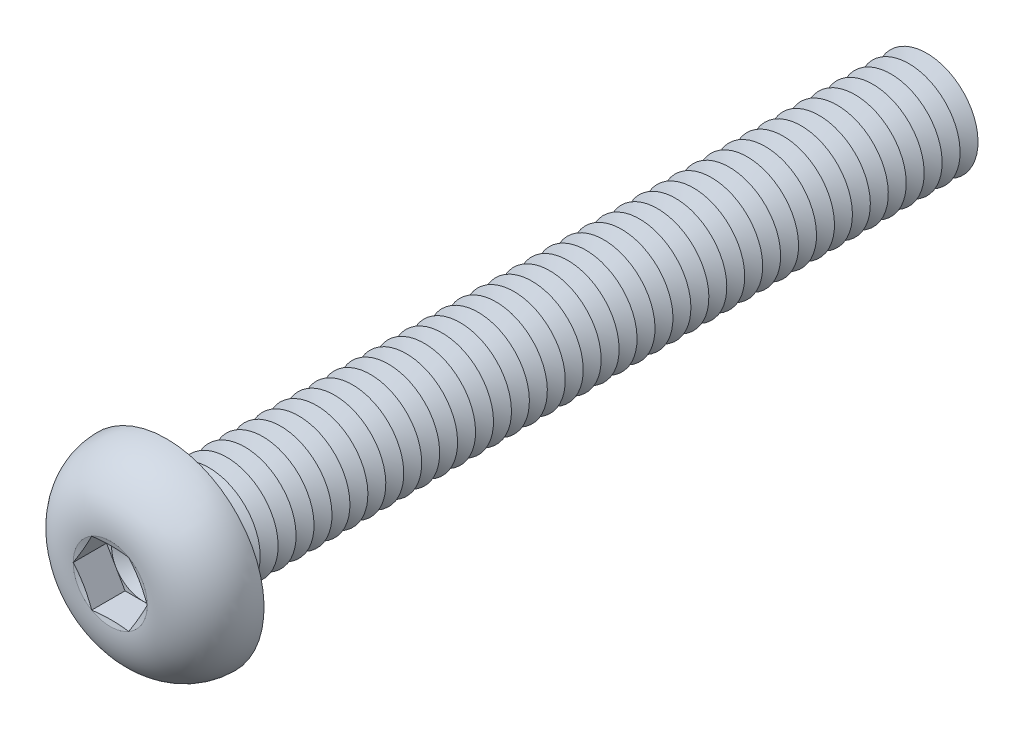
ISO-10303-21;
HEADER;
FILE_DESCRIPTION(('STEP AP214'),'2;1');
FILE_NAME('part.step','',(''),(''),'','','');
FILE_SCHEMA(('AUTOMOTIVE_DESIGN { 1 0 10303 214 1 1 1 1 }'));
ENDSEC;
DATA;
#1=APPLICATION_CONTEXT('core data for automotive mechanical design processes');
#2=APPLICATION_PROTOCOL_DEFINITION('international standard','automotive_design',2000,#1);
#3=PRODUCT_CONTEXT('',#1,'mechanical');
#4=PRODUCT('Part','Part','',(#3));
#5=PRODUCT_RELATED_PRODUCT_CATEGORY('part','',(#4));
#6=PRODUCT_DEFINITION_FORMATION('','',#4);
#7=PRODUCT_DEFINITION_CONTEXT('part definition',#1,'design');
#8=PRODUCT_DEFINITION('design','',#6,#7);
#9=PRODUCT_DEFINITION_SHAPE('','',#8);
#10=(LENGTH_UNIT() NAMED_UNIT(*) SI_UNIT(.MILLI.,.METRE.));
#11=(NAMED_UNIT(*) PLANE_ANGLE_UNIT() SI_UNIT($,.RADIAN.));
#12=(NAMED_UNIT(*) SI_UNIT($,.STERADIAN.) SOLID_ANGLE_UNIT());
#13=UNCERTAINTY_MEASURE_WITH_UNIT(LENGTH_MEASURE(1.E-05),#10,'distance_accuracy_value','');
#14=(GEOMETRIC_REPRESENTATION_CONTEXT(3) GLOBAL_UNCERTAINTY_ASSIGNED_CONTEXT((#13)) GLOBAL_UNIT_ASSIGNED_CONTEXT((#10,
#11,#12)) REPRESENTATION_CONTEXT('',''));
#15=CARTESIAN_POINT('',(0.,0.,0.));
#16=DIRECTION('',(0.,0.,1.));
#17=DIRECTION('',(1.,0.,0.));
#18=AXIS2_PLACEMENT_3D('',#15,#16,#17);
#19=CARTESIAN_POINT('',(0.,0.,0.899999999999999));
#20=DIRECTION('',(0.,0.,1.));
#21=DIRECTION('',(1.,0.,0.));
#22=AXIS2_PLACEMENT_3D('',#19,#20,#21);
#23=PLANE('',#22);
#24=CARTESIAN_POINT('',(0.,0.,0.899999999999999));
#25=DIRECTION('',(0.,0.,1.));
#26=DIRECTION('',(1.,0.,0.));
#27=AXIS2_PLACEMENT_3D('',#24,#25,#26);
#28=CIRCLE('',#27,1.24999941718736);
#29=CARTESIAN_POINT('',(1.08253125,0.624999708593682,0.899999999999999));
#30=VERTEX_POINT('',#29);
#31=CARTESIAN_POINT('',(0.,1.24999941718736,0.899999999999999));
#32=VERTEX_POINT('',#31);
#33=EDGE_CURVE('E118',#30,#32,#28,.T.);
#34=ORIENTED_EDGE('',*,*,#33,.F.);
#35=DIRECTION('',(-0.5,0.866025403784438,0.));
#36=VECTOR('',#35,1.);
#37=CARTESIAN_POINT('',(1.443375,0.,0.899999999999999));
#38=LINE('',#37,#36);
#39=CARTESIAN_POINT('',(0.7216875,1.24999941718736,0.899999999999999));
#40=VERTEX_POINT('',#39);
#41=EDGE_CURVE('E125',#30,#40,#38,.T.);
#42=ORIENTED_EDGE('',*,*,#41,.T.);
#43=DIRECTION('',(-1.,0.,0.));
#44=VECTOR('',#43,1.);
#45=CARTESIAN_POINT('',(0.7216875,1.24999941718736,0.899999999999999));
#46=LINE('',#45,#44);
#47=EDGE_CURVE('E136',#40,#32,#46,.T.);
#48=ORIENTED_EDGE('',*,*,#47,.T.);
#49=EDGE_LOOP('',(#34,#42,#48));
#50=FACE_BOUND('',#49,.T.);
#51=ADVANCED_FACE('F39',(#50),#23,.T.);
#52=CARTESIAN_POINT('',(0.,0.,0.899999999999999));
#53=DIRECTION('',(0.,0.,1.));
#54=DIRECTION('',(1.,0.,0.));
#55=AXIS2_PLACEMENT_3D('',#52,#53,#54);
#56=CIRCLE('',#55,1.24999941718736);
#57=CARTESIAN_POINT('',(-1.08253125,0.624999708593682,0.899999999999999));
#58=VERTEX_POINT('',#57);
#59=EDGE_CURVE('E11',#32,#58,#56,.T.);
#60=ORIENTED_EDGE('',*,*,#59,.F.);
#61=CARTESIAN_POINT('',(-0.721687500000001,1.24999941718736,0.899999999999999));
#62=VERTEX_POINT('',#61);
#63=EDGE_CURVE('E131',#32,#62,#46,.T.);
#64=ORIENTED_EDGE('',*,*,#63,.T.);
#65=DIRECTION('',(-0.5,-0.866025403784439,0.));
#66=VECTOR('',#65,1.);
#67=CARTESIAN_POINT('',(-0.721687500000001,1.24999941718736,0.899999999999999));
#68=LINE('',#67,#66);
#69=EDGE_CURVE('E134',#62,#58,#68,.T.);
#70=ORIENTED_EDGE('',*,*,#69,.T.);
#71=EDGE_LOOP('',(#60,#64,#70));
#72=FACE_BOUND('',#71,.T.);
#73=ADVANCED_FACE('F130',(#72),#23,.T.);
#74=CARTESIAN_POINT('',(-1.08253125,-0.624999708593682,0.899999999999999));
#75=VERTEX_POINT('',#74);
#76=EDGE_CURVE('E49',#58,#75,#56,.T.);
#77=ORIENTED_EDGE('',*,*,#76,.F.);
#78=CARTESIAN_POINT('',(-1.443375,0.,0.899999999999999));
#79=VERTEX_POINT('',#78);
#80=EDGE_CURVE('E143',#58,#79,#68,.T.);
#81=ORIENTED_EDGE('',*,*,#80,.T.);
#82=DIRECTION('',(0.5,-0.866025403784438,0.));
#83=VECTOR('',#82,1.);
#84=CARTESIAN_POINT('',(-1.443375,0.,0.899999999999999));
#85=LINE('',#84,#83);
#86=EDGE_CURVE('E152',#79,#75,#85,.T.);
#87=ORIENTED_EDGE('',*,*,#86,.T.);
#88=EDGE_LOOP('',(#77,#81,#87));
#89=FACE_BOUND('',#88,.T.);
#90=ADVANCED_FACE('F610',(#89),#23,.T.);
#91=CARTESIAN_POINT('',(0.,-1.24999941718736,0.899999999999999));
#92=VERTEX_POINT('',#91);
#93=EDGE_CURVE('E593',#75,#92,#56,.T.);
#94=ORIENTED_EDGE('',*,*,#93,.F.);
#95=CARTESIAN_POINT('',(-0.721687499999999,-1.24999941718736,0.899999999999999));
#96=VERTEX_POINT('',#95);
#97=EDGE_CURVE('E151',#75,#96,#85,.T.);
#98=ORIENTED_EDGE('',*,*,#97,.T.);
#99=DIRECTION('',(1.,0.,0.));
#100=VECTOR('',#99,1.);
#101=CARTESIAN_POINT('',(-0.721687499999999,-1.24999941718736,0.899999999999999));
#102=LINE('',#101,#100);
#103=EDGE_CURVE('E157',#96,#92,#102,.T.);
#104=ORIENTED_EDGE('',*,*,#103,.T.);
#105=EDGE_LOOP('',(#94,#98,#104));
#106=FACE_BOUND('',#105,.T.);
#107=ADVANCED_FACE('F603',(#106),#23,.T.);
#108=CARTESIAN_POINT('',(1.08253125,-0.624999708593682,0.899999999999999));
#109=VERTEX_POINT('',#108);
#110=EDGE_CURVE('E56',#92,#109,#56,.T.);
#111=ORIENTED_EDGE('',*,*,#110,.F.);
#112=CARTESIAN_POINT('',(0.721687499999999,-1.24999941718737,0.899999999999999));
#113=VERTEX_POINT('',#112);
#114=EDGE_CURVE('E156',#92,#113,#102,.T.);
#115=ORIENTED_EDGE('',*,*,#114,.T.);
#116=DIRECTION('',(0.5,0.866025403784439,0.));
#117=VECTOR('',#116,1.);
#118=CARTESIAN_POINT('',(0.721687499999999,-1.24999941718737,0.899999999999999));
#119=LINE('',#118,#117);
#120=EDGE_CURVE('E162',#113,#109,#119,.T.);
#121=ORIENTED_EDGE('',*,*,#120,.T.);
#122=EDGE_LOOP('',(#111,#115,#121));
#123=FACE_BOUND('',#122,.T.);
#124=ADVANCED_FACE('F677',(#123),#23,.T.);
#125=CARTESIAN_POINT('',(0.,0.,2.2));
#126=DIRECTION('',(0.,0.,1.));
#127=DIRECTION('',(0.,-1.,0.));
#128=AXIS2_PLACEMENT_3D('',#125,#126,#127);
#129=CONICAL_SURFACE('',#128,1.443375,1.30899693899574);
#130=CARTESIAN_POINT('',(1.44349047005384,-0.00020000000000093,2.2000309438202));
#131=CARTESIAN_POINT('',(1.41351104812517,0.0517258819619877,2.19199301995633));
#132=CARTESIAN_POINT('',(1.38347725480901,0.103745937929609,2.18469579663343));
#133=CARTESIAN_POINT('',(1.32330355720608,0.20796983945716,2.17187512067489));
#134=CARTESIAN_POINT('',(1.29316361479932,0.260173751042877,2.16635238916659));
#135=CARTESIAN_POINT('',(1.23296043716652,0.364448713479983,2.15740323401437));
#136=CARTESIAN_POINT('',(1.20289760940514,0.416519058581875,2.15396613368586));
#137=CARTESIAN_POINT('',(1.14273359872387,0.520726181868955,2.14935732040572));
#138=CARTESIAN_POINT('',(1.11263242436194,0.572862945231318,2.14818516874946));
#139=CARTESIAN_POINT('',(1.05243007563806,0.677136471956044,2.14818516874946));
#140=CARTESIAN_POINT('',(1.02232890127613,0.729273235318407,2.14935732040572));
#141=CARTESIAN_POINT('',(0.962164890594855,0.833480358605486,2.15396613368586));
#142=CARTESIAN_POINT('',(0.932102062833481,0.885550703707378,2.15740323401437));
#143=CARTESIAN_POINT('',(0.87189888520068,0.989825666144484,2.16635238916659));
#144=CARTESIAN_POINT('',(0.841758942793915,1.0420295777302,2.17187512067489));
#145=CARTESIAN_POINT('',(0.78158524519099,1.14625347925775,2.18469579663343));
#146=CARTESIAN_POINT('',(0.751551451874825,1.19827353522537,2.19199301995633));
#147=CARTESIAN_POINT('',(0.721572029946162,1.25019941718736,2.2000309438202));
#148=B_SPLINE_CURVE_WITH_KNOTS('',3,(#130,#131,#132,#133,#134,#135,#136,#137,#138,#139,#140,
#141,#142,#143,#144,#145,#146,#147),.UNSPECIFIED.,.F.,.F.,(4,2,2,2,2,2,2,2,4),(0.,
0.181495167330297,0.363063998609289,0.543695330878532,0.724291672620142,0.904888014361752,
1.08551934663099,1.26708817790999,1.44858334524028),.UNSPECIFIED.);
#149=CARTESIAN_POINT('',(1.443375,0.,2.2));
#150=VERTEX_POINT('',#149);
#151=CARTESIAN_POINT('',(0.72168750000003,1.24999941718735,2.2));
#152=VERTEX_POINT('',#151);
#153=EDGE_CURVE('E221',#150,#152,#148,.T.);
#154=ORIENTED_EDGE('',*,*,#153,.F.);
#155=CARTESIAN_POINT('',(0.,0.,2.2));
#156=DIRECTION('',(0.,0.,-1.));
#157=DIRECTION('',(0.,1.,0.));
#158=AXIS2_PLACEMENT_3D('',#155,#156,#157);
#159=CIRCLE('',#158,1.443375);
#160=EDGE_CURVE('E573',#152,#150,#159,.T.);
#161=ORIENTED_EDGE('',*,*,#160,.F.);
#162=EDGE_LOOP('',(#154,#161));
#163=FACE_BOUND('',#162,.T.);
#164=ADVANCED_FACE('F681',(#163),#129,.F.);
#165=CARTESIAN_POINT('',(0.721572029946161,-1.25019941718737,2.2000309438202));
#166=CARTESIAN_POINT('',(0.751551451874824,-1.19827353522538,2.19199301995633));
#167=CARTESIAN_POINT('',(0.78158524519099,-1.14625347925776,2.18469579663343));
#168=CARTESIAN_POINT('',(0.841758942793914,-1.0420295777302,2.17187512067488));
#169=CARTESIAN_POINT('',(0.87189888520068,-0.989825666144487,2.16635238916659));
#170=CARTESIAN_POINT('',(0.932102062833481,-0.885550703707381,2.15740323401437));
#171=CARTESIAN_POINT('',(0.962164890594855,-0.833480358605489,2.15396613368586));
#172=CARTESIAN_POINT('',(1.02232890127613,-0.729273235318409,2.14935732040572));
#173=CARTESIAN_POINT('',(1.05243007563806,-0.677136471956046,2.14818516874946));
#174=CARTESIAN_POINT('',(1.11263242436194,-0.57286294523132,2.14818516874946));
#175=CARTESIAN_POINT('',(1.14273359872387,-0.520726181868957,2.14935732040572));
#176=CARTESIAN_POINT('',(1.20289760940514,-0.416519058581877,2.15396613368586));
#177=CARTESIAN_POINT('',(1.23296043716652,-0.364448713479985,2.15740323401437));
#178=CARTESIAN_POINT('',(1.29316361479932,-0.260173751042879,2.16635238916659));
#179=CARTESIAN_POINT('',(1.32330355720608,-0.207969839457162,2.17187512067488));
#180=CARTESIAN_POINT('',(1.38347725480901,-0.103745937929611,2.18469579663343));
#181=CARTESIAN_POINT('',(1.41351104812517,-0.0517258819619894,2.19199301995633));
#182=CARTESIAN_POINT('',(1.44349047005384,0.000199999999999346,2.2000309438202));
#183=B_SPLINE_CURVE_WITH_KNOTS('',3,(#165,#166,#167,#168,#169,#170,#171,#172,#173,#174,#175,
#176,#177,#178,#179,#180,#181,#182),.UNSPECIFIED.,.F.,.F.,(4,2,2,2,2,2,2,2,4),(0.,
0.181495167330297,0.36306399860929,0.543695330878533,0.724291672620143,0.904888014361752,
1.085519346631,1.26708817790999,1.44858334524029),.UNSPECIFIED.);
#184=CARTESIAN_POINT('',(0.721687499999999,-1.24999941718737,2.2));
#185=VERTEX_POINT('',#184);
#186=EDGE_CURVE('E230',#185,#150,#183,.T.);
#187=ORIENTED_EDGE('',*,*,#186,.F.);
#188=EDGE_CURVE('E578',#150,#185,#159,.T.);
#189=ORIENTED_EDGE('',*,*,#188,.F.);
#190=EDGE_LOOP('',(#187,#189));
#191=FACE_BOUND('',#190,.T.);
#192=ADVANCED_FACE('F643',(#191),#129,.F.);
#193=CARTESIAN_POINT('',(-2.17815859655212,-1.24999941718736,2.48616275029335));
#194=CARTESIAN_POINT('',(-2.07269794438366,-1.24999941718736,2.46168811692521));
#195=CARTESIAN_POINT('',(-1.96714913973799,-1.24999941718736,2.43756889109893));
#196=CARTESIAN_POINT('',(-1.75576352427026,-1.24999941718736,2.39052699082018));
#197=CARTESIAN_POINT('',(-1.64992665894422,-1.24999941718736,2.36760456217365));
#198=CARTESIAN_POINT('',(-1.43690237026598,-1.24999941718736,2.32324543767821));
#199=CARTESIAN_POINT('',(-1.32971158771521,-1.24999941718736,2.30182468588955));
#200=CARTESIAN_POINT('',(-1.11482745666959,-1.24999941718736,2.26156703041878));
#201=CARTESIAN_POINT('',(-1.00713406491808,-1.24999941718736,2.24273035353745));
#202=CARTESIAN_POINT('',(-0.794044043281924,-1.24999941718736,2.20939137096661));
#203=CARTESIAN_POINT('',(-0.688664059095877,-1.24999941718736,2.19478562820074));
#204=CARTESIAN_POINT('',(-0.477310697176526,-1.24999941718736,2.17085809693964));
#205=CARTESIAN_POINT('',(-0.371337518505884,-1.24999941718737,2.16153463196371));
#206=CARTESIAN_POINT('',(-0.159455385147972,-1.24999941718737,2.14976770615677));
#207=CARTESIAN_POINT('',(-0.0535482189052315,-1.24999941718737,2.14729400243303));
#208=CARTESIAN_POINT('',(0.158189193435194,-1.24999941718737,2.14966287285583));
#209=CARTESIAN_POINT('',(0.264019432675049,-1.24999941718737,2.15450603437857));
#210=CARTESIAN_POINT('',(0.445148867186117,-1.24999941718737,2.16825380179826));
#211=CARTESIAN_POINT('',(0.520574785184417,-1.24999941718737,2.17561242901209));
#212=CARTESIAN_POINT('',(0.671115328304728,-1.24999941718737,2.19297000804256));
#213=CARTESIAN_POINT('',(0.746229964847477,-1.24999941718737,2.20296886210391));
#214=CARTESIAN_POINT('',(0.896387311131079,-1.24999941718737,2.22505910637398));
#215=CARTESIAN_POINT('',(0.971429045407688,-1.24999941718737,2.23715700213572));
#216=CARTESIAN_POINT('',(1.12124320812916,-1.24999941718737,2.26292371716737));
#217=CARTESIAN_POINT('',(1.19601562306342,-1.24999941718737,2.27659261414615));
#218=CARTESIAN_POINT('',(1.34686913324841,-1.24999941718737,2.30540811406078));
#219=CARTESIAN_POINT('',(1.42294548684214,-1.24999941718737,2.32057934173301));
#220=CARTESIAN_POINT('',(1.57490676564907,-1.24999941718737,2.35185113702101));
#221=CARTESIAN_POINT('',(1.65079168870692,-1.24999941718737,2.36795171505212));
#222=CARTESIAN_POINT('',(1.80199501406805,-1.24999941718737,2.40076814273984));
#223=CARTESIAN_POINT('',(1.87731425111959,-1.24999941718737,2.41748016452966));
#224=CARTESIAN_POINT('',(2.02782424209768,-1.24999941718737,2.45144971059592));
#225=CARTESIAN_POINT('',(2.10301500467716,-1.24999941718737,2.46870719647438));
#226=CARTESIAN_POINT('',(2.17815859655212,-1.24999941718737,2.48616275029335));
#227=B_SPLINE_CURVE_WITH_KNOTS('',3,(#193,#194,#195,#196,#197,#198,#199,#200,#201,#202,#203,
#204,#205,#206,#207,#208,#209,#210,#211,#212,#213,#214,#215,#216,#217,#218,#219,#220,#221,#222,
#223,#224,#225,#226),.UNSPECIFIED.,.F.,.F.,(4,2,2,2,2,2,2,2,2,2,2,2,2,2,2,2,4),(0.,
0.324797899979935,0.649662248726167,0.97757231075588,1.30551113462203,1.62458166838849,
1.94355087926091,2.26110952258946,2.5786936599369,2.80599541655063,3.03328875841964,
3.2612995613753,3.48932164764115,3.7220371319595,3.95475522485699,4.18620606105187,
4.41764064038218),.UNSPECIFIED.);
#228=CARTESIAN_POINT('',(-0.721687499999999,-1.24999941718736,2.2));
#229=VERTEX_POINT('',#228);
#230=EDGE_CURVE('E623',#229,#185,#227,.T.);
#231=ORIENTED_EDGE('',*,*,#230,.F.);
#232=EDGE_CURVE('E636',#185,#229,#159,.T.);
#233=ORIENTED_EDGE('',*,*,#232,.F.);
#234=EDGE_LOOP('',(#231,#233));
#235=FACE_BOUND('',#234,.T.);
#236=ADVANCED_FACE('F648',(#235),#129,.F.);
#237=CARTESIAN_POINT('',(-1.44349047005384,0.000199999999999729,2.2000309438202));
#238=CARTESIAN_POINT('',(-1.41351104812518,-0.0517258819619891,2.19199301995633));
#239=CARTESIAN_POINT('',(-1.38347725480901,-0.103745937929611,2.18469579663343));
#240=CARTESIAN_POINT('',(-1.32330355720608,-0.207969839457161,2.17187512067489));
#241=CARTESIAN_POINT('',(-1.29316361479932,-0.260173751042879,2.16635238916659));
#242=CARTESIAN_POINT('',(-1.23296043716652,-0.364448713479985,2.15740323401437));
#243=CARTESIAN_POINT('',(-1.20289760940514,-0.416519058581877,2.15396613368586));
#244=CARTESIAN_POINT('',(-1.14273359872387,-0.520726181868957,2.14935732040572));
#245=CARTESIAN_POINT('',(-1.11263242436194,-0.57286294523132,2.14818516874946));
#246=CARTESIAN_POINT('',(-1.05243007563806,-0.677136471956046,2.14818516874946));
#247=CARTESIAN_POINT('',(-1.02232890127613,-0.729273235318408,2.14935732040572));
#248=CARTESIAN_POINT('',(-0.962164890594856,-0.833480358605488,2.15396613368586));
#249=CARTESIAN_POINT('',(-0.932102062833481,-0.885550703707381,2.15740323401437));
#250=CARTESIAN_POINT('',(-0.87189888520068,-0.989825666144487,2.16635238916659));
#251=CARTESIAN_POINT('',(-0.841758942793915,-1.0420295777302,2.17187512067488));
#252=CARTESIAN_POINT('',(-0.78158524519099,-1.14625347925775,2.18469579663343));
#253=CARTESIAN_POINT('',(-0.751551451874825,-1.19827353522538,2.19199301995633));
#254=CARTESIAN_POINT('',(-0.721572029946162,-1.25019941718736,2.2000309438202));
#255=B_SPLINE_CURVE_WITH_KNOTS('',3,(#237,#238,#239,#240,#241,#242,#243,#244,#245,#246,#247,
#248,#249,#250,#251,#252,#253,#254),.UNSPECIFIED.,.F.,.F.,(4,2,2,2,2,2,2,2,4),(0.,
0.181495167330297,0.36306399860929,0.543695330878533,0.724291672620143,0.904888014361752,
1.085519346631,1.26708817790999,1.44858334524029),.UNSPECIFIED.);
#256=CARTESIAN_POINT('',(-1.443375,0.,2.2));
#257=VERTEX_POINT('',#256);
#258=EDGE_CURVE('E615',#257,#229,#255,.T.);
#259=ORIENTED_EDGE('',*,*,#258,.F.);
#260=EDGE_CURVE('E621',#229,#257,#159,.T.);
#261=ORIENTED_EDGE('',*,*,#260,.F.);
#262=EDGE_LOOP('',(#259,#261));
#263=FACE_BOUND('',#262,.T.);
#264=ADVANCED_FACE('F619',(#263),#129,.F.);
#265=CARTESIAN_POINT('',(-0.721572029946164,1.25019941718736,2.2000309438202));
#266=CARTESIAN_POINT('',(-0.751551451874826,1.19827353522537,2.19199301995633));
#267=CARTESIAN_POINT('',(-0.781585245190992,1.14625347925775,2.18469579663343));
#268=CARTESIAN_POINT('',(-0.841758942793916,1.0420295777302,2.17187512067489));
#269=CARTESIAN_POINT('',(-0.871898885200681,0.989825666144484,2.16635238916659));
#270=CARTESIAN_POINT('',(-0.932102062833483,0.885550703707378,2.15740323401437));
#271=CARTESIAN_POINT('',(-0.962164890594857,0.833480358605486,2.15396613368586));
#272=CARTESIAN_POINT('',(-1.02232890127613,0.729273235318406,2.14935732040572));
#273=CARTESIAN_POINT('',(-1.05243007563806,0.677136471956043,2.14818516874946));
#274=CARTESIAN_POINT('',(-1.11263242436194,0.572862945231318,2.14818516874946));
#275=CARTESIAN_POINT('',(-1.14273359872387,0.520726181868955,2.14935732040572));
#276=CARTESIAN_POINT('',(-1.20289760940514,0.416519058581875,2.15396613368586));
#277=CARTESIAN_POINT('',(-1.23296043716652,0.364448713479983,2.15740323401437));
#278=CARTESIAN_POINT('',(-1.29316361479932,0.260173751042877,2.16635238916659));
#279=CARTESIAN_POINT('',(-1.32330355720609,0.20796983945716,2.17187512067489));
#280=CARTESIAN_POINT('',(-1.38347725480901,0.10374593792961,2.18469579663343));
#281=CARTESIAN_POINT('',(-1.41351104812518,0.0517258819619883,2.19199301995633));
#282=CARTESIAN_POINT('',(-1.44349047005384,-0.000200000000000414,2.2000309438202));
#283=B_SPLINE_CURVE_WITH_KNOTS('',3,(#265,#266,#267,#268,#269,#270,#271,#272,#273,#274,#275,
#276,#277,#278,#279,#280,#281,#282),.UNSPECIFIED.,.F.,.F.,(4,2,2,2,2,2,2,2,4),(0.,
0.181495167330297,0.363063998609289,0.543695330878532,0.724291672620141,0.90488801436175,
1.08551934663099,1.26708817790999,1.44858334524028),.UNSPECIFIED.);
#284=CARTESIAN_POINT('',(-0.721687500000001,1.24999941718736,2.2));
#285=VERTEX_POINT('',#284);
#286=EDGE_CURVE('E194',#285,#257,#283,.T.);
#287=ORIENTED_EDGE('',*,*,#286,.F.);
#288=EDGE_CURVE('E626',#257,#285,#159,.T.);
#289=ORIENTED_EDGE('',*,*,#288,.F.);
#290=EDGE_LOOP('',(#287,#289));
#291=FACE_BOUND('',#290,.T.);
#292=ADVANCED_FACE('F627',(#291),#129,.F.);
#293=CARTESIAN_POINT('',(0.,0.,-27.55));
#294=DIRECTION('',(0.,0.,1.));
#295=DIRECTION('',(0.,-1.,0.));
#296=AXIS2_PLACEMENT_3D('',#293,#294,#295);
#297=CONICAL_SURFACE('',#296,1.99999999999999,1.0471975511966);
#298=CARTESIAN_POINT('',(0.,0.,-27.9));
#299=DIRECTION('',(0.,0.,1.));
#300=DIRECTION('',(0.,-1.,0.));
#301=AXIS2_PLACEMENT_3D('',#298,#299,#300);
#302=CIRCLE('',#301,1.39378221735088);
#303=CARTESIAN_POINT('',(0.,-1.39378221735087,-27.9));
#304=VERTEX_POINT('',#303);
#305=EDGE_CURVE('E544',#304,#304,#302,.T.);
#306=ORIENTED_EDGE('',*,*,#305,.T.);
#307=EDGE_LOOP('',(#306));
#308=FACE_BOUND('',#307,.T.);
#309=CARTESIAN_POINT('',(0.,0.,-27.55));
#310=DIRECTION('',(0.,0.,1.));
#311=DIRECTION('',(0.,-1.,0.));
#312=AXIS2_PLACEMENT_3D('',#309,#310,#311);
#313=CIRCLE('',#312,1.99999999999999);
#314=CARTESIAN_POINT('',(0.,-1.99999999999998,-27.55));
#315=VERTEX_POINT('',#314);
#316=EDGE_CURVE('E540',#315,#315,#313,.T.);
#317=ORIENTED_EDGE('',*,*,#316,.F.);
#318=EDGE_LOOP('',(#317));
#319=FACE_BOUND('',#318,.T.);
#320=ADVANCED_FACE('F709',(#308,#319),#297,.T.);
#321=CARTESIAN_POINT('',(0.,0.,-27.9));
#322=DIRECTION('',(0.,0.,-1.));
#323=DIRECTION('',(0.,1.,0.));
#324=AXIS2_PLACEMENT_3D('',#321,#322,#323);
#325=CONICAL_SURFACE('',#324,1.39378221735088,1.0471975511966);
#326=CARTESIAN_POINT('',(0.,0.,-28.25));
#327=DIRECTION('',(0.,0.,1.));
#328=DIRECTION('',(0.,-1.,0.));
#329=AXIS2_PLACEMENT_3D('',#326,#327,#328);
#330=CIRCLE('',#329,1.99999999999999);
#331=CARTESIAN_POINT('',(0.,-1.99999999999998,-28.25));
#332=VERTEX_POINT('',#331);
#333=EDGE_CURVE('E548',#332,#332,#330,.T.);
#334=ORIENTED_EDGE('',*,*,#333,.T.);
#335=EDGE_LOOP('',(#334));
#336=FACE_BOUND('',#335,.T.);
#337=ORIENTED_EDGE('',*,*,#305,.F.);
#338=EDGE_LOOP('',(#337));
#339=FACE_BOUND('',#338,.T.);
#340=ADVANCED_FACE('F714',(#336,#339),#325,.T.);
#341=CARTESIAN_POINT('',(0.,2.,-30.));
#342=DIRECTION('',(0.,0.,-1.));
#343=DIRECTION('',(0.,1.,0.));
#344=AXIS2_PLACEMENT_3D('',#341,#342,#343);
#345=PLANE('',#344);
#346=CARTESIAN_POINT('',(0.,0.,-30.));
#347=DIRECTION('',(0.,0.,1.));
#348=DIRECTION('',(0.,-1.,0.));
#349=AXIS2_PLACEMENT_3D('',#346,#347,#348);
#350=CIRCLE('',#349,1.39378221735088);
#351=CARTESIAN_POINT('',(0.,-1.39378221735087,-30.));
#352=VERTEX_POINT('',#351);
#353=EDGE_CURVE('E568',#352,#352,#350,.T.);
#354=ORIENTED_EDGE('',*,*,#353,.F.);
#355=EDGE_LOOP('',(#354));
#356=FACE_BOUND('',#355,.T.);
#357=ADVANCED_FACE('F889',(#356),#345,.T.);
#358=CARTESIAN_POINT('',(0.,0.,-29.65));
#359=DIRECTION('',(0.,0.,1.));
#360=DIRECTION('',(0.,-1.,0.));
#361=AXIS2_PLACEMENT_3D('',#358,#359,#360);
#362=CONICAL_SURFACE('',#361,1.99999999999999,1.0471975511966);
#363=ORIENTED_EDGE('',*,*,#353,.T.);
#364=EDGE_LOOP('',(#363));
#365=FACE_BOUND('',#364,.T.);
#366=CARTESIAN_POINT('',(0.,0.,-29.65));
#367=DIRECTION('',(0.,0.,1.));
#368=DIRECTION('',(0.,-1.,0.));
#369=AXIS2_PLACEMENT_3D('',#366,#367,#368);
#370=CIRCLE('',#369,1.99999999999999);
#371=CARTESIAN_POINT('',(0.,-1.99999999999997,-29.65));
#372=VERTEX_POINT('',#371);
#373=EDGE_CURVE('E564',#372,#372,#370,.T.);
#374=ORIENTED_EDGE('',*,*,#373,.F.);
#375=EDGE_LOOP('',(#374));
#376=FACE_BOUND('',#375,.T.);
#377=ADVANCED_FACE('F882',(#365,#376),#362,.T.);
#378=CARTESIAN_POINT('',(0.,0.,-29.3));
#379=DIRECTION('',(0.,0.,-1.));
#380=DIRECTION('',(0.,1.,0.));
#381=AXIS2_PLACEMENT_3D('',#378,#379,#380);
#382=CONICAL_SURFACE('',#381,1.39378221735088,1.0471975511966);
#383=ORIENTED_EDGE('',*,*,#373,.T.);
#384=EDGE_LOOP('',(#383));
#385=FACE_BOUND('',#384,.T.);
#386=CARTESIAN_POINT('',(0.,0.,-29.3));
#387=DIRECTION('',(0.,0.,1.));
#388=DIRECTION('',(0.,-1.,0.));
#389=AXIS2_PLACEMENT_3D('',#386,#387,#388);
#390=CIRCLE('',#389,1.39378221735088);
#391=CARTESIAN_POINT('',(0.,-1.39378221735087,-29.3));
#392=VERTEX_POINT('',#391);
#393=EDGE_CURVE('E560',#392,#392,#390,.T.);
#394=ORIENTED_EDGE('',*,*,#393,.F.);
#395=EDGE_LOOP('',(#394));
#396=FACE_BOUND('',#395,.T.);
#397=ADVANCED_FACE('F888',(#385,#396),#382,.T.);
#398=CARTESIAN_POINT('',(0.,0.,-28.95));
#399=DIRECTION('',(0.,0.,1.));
#400=DIRECTION('',(0.,-1.,0.));
#401=AXIS2_PLACEMENT_3D('',#398,#399,#400);
#402=CONICAL_SURFACE('',#401,1.99999999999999,1.0471975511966);
#403=ORIENTED_EDGE('',*,*,#393,.T.);
#404=EDGE_LOOP('',(#403));
#405=FACE_BOUND('',#404,.T.);
#406=CARTESIAN_POINT('',(0.,0.,-28.95));
#407=DIRECTION('',(0.,0.,1.));
#408=DIRECTION('',(0.,-1.,0.));
#409=AXIS2_PLACEMENT_3D('',#406,#407,#408);
#410=CIRCLE('',#409,1.99999999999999);
#411=CARTESIAN_POINT('',(0.,-1.99999999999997,-28.95));
#412=VERTEX_POINT('',#411);
#413=EDGE_CURVE('E556',#412,#412,#410,.T.);
#414=ORIENTED_EDGE('',*,*,#413,.F.);
#415=EDGE_LOOP('',(#414));
#416=FACE_BOUND('',#415,.T.);
#417=ADVANCED_FACE('F920',(#405,#416),#402,.T.);
#418=CARTESIAN_POINT('',(0.,0.,-28.6));
#419=DIRECTION('',(0.,0.,-1.));
#420=DIRECTION('',(0.,1.,0.));
#421=AXIS2_PLACEMENT_3D('',#418,#419,#420);
#422=CONICAL_SURFACE('',#421,1.39378221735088,1.0471975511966);
#423=ORIENTED_EDGE('',*,*,#413,.T.);
#424=EDGE_LOOP('',(#423));
#425=FACE_BOUND('',#424,.T.);
#426=CARTESIAN_POINT('',(0.,0.,-28.6));
#427=DIRECTION('',(0.,0.,1.));
#428=DIRECTION('',(0.,-1.,0.));
#429=AXIS2_PLACEMENT_3D('',#426,#427,#428);
#430=CIRCLE('',#429,1.39378221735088);
#431=CARTESIAN_POINT('',(0.,-1.39378221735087,-28.6));
#432=VERTEX_POINT('',#431);
#433=EDGE_CURVE('E552',#432,#432,#430,.T.);
#434=ORIENTED_EDGE('',*,*,#433,.F.);
#435=EDGE_LOOP('',(#434));
#436=FACE_BOUND('',#435,.T.);
#437=ADVANCED_FACE('F930',(#425,#436),#422,.T.);
#438=CARTESIAN_POINT('',(0.,0.,-28.25));
#439=DIRECTION('',(0.,0.,1.));
#440=DIRECTION('',(0.,-1.,0.));
#441=AXIS2_PLACEMENT_3D('',#438,#439,#440);
#442=CONICAL_SURFACE('',#441,1.99999999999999,1.0471975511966);
#443=ORIENTED_EDGE('',*,*,#433,.T.);
#444=EDGE_LOOP('',(#443));
#445=FACE_BOUND('',#444,.T.);
#446=ORIENTED_EDGE('',*,*,#333,.F.);
#447=EDGE_LOOP('',(#446));
#448=FACE_BOUND('',#447,.T.);
#449=ADVANCED_FACE('F940',(#445,#448),#442,.T.);
#450=CARTESIAN_POINT('',(0.,0.,-26.85));
#451=DIRECTION('',(0.,0.,1.));
#452=DIRECTION('',(0.,-1.,0.));
#453=AXIS2_PLACEMENT_3D('',#450,#451,#452);
#454=CONICAL_SURFACE('',#453,1.99999999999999,1.0471975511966);
#455=CARTESIAN_POINT('',(0.,0.,-27.2));
#456=DIRECTION('',(0.,0.,1.));
#457=DIRECTION('',(0.,-1.,0.));
#458=AXIS2_PLACEMENT_3D('',#455,#456,#457);
#459=CIRCLE('',#458,1.39378221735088);
#460=CARTESIAN_POINT('',(0.,-1.39378221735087,-27.2));
#461=VERTEX_POINT('',#460);
#462=EDGE_CURVE('E536',#461,#461,#459,.T.);
#463=ORIENTED_EDGE('',*,*,#462,.T.);
#464=EDGE_LOOP('',(#463));
#465=FACE_BOUND('',#464,.T.);
#466=CARTESIAN_POINT('',(0.,0.,-26.85));
#467=DIRECTION('',(0.,0.,1.));
#468=DIRECTION('',(0.,-1.,0.));
#469=AXIS2_PLACEMENT_3D('',#466,#467,#468);
#470=CIRCLE('',#469,1.99999999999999);
#471=CARTESIAN_POINT('',(0.,-1.99999999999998,-26.85));
#472=VERTEX_POINT('',#471);
#473=EDGE_CURVE('E532',#472,#472,#470,.T.);
#474=ORIENTED_EDGE('',*,*,#473,.F.);
#475=EDGE_LOOP('',(#474));
#476=FACE_BOUND('',#475,.T.);
#477=ADVANCED_FACE('F950',(#465,#476),#454,.T.);
#478=CARTESIAN_POINT('',(0.,0.,-27.2));
#479=DIRECTION('',(0.,0.,-1.));
#480=DIRECTION('',(0.,1.,0.));
#481=AXIS2_PLACEMENT_3D('',#478,#479,#480);
#482=CONICAL_SURFACE('',#481,1.39378221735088,1.0471975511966);
#483=ORIENTED_EDGE('',*,*,#316,.T.);
#484=EDGE_LOOP('',(#483));
#485=FACE_BOUND('',#484,.T.);
#486=ORIENTED_EDGE('',*,*,#462,.F.);
#487=EDGE_LOOP('',(#486));
#488=FACE_BOUND('',#487,.T.);
#489=ADVANCED_FACE('F960',(#485,#488),#482,.T.);
#490=CARTESIAN_POINT('',(0.,0.,-26.15));
#491=DIRECTION('',(0.,0.,1.));
#492=DIRECTION('',(0.,-1.,0.));
#493=AXIS2_PLACEMENT_3D('',#490,#491,#492);
#494=CONICAL_SURFACE('',#493,1.99999999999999,1.0471975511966);
#495=CARTESIAN_POINT('',(0.,0.,-26.5));
#496=DIRECTION('',(0.,0.,1.));
#497=DIRECTION('',(0.,-1.,0.));
#498=AXIS2_PLACEMENT_3D('',#495,#496,#497);
#499=CIRCLE('',#498,1.39378221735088);
#500=CARTESIAN_POINT('',(0.,-1.39378221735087,-26.5));
#501=VERTEX_POINT('',#500);
#502=EDGE_CURVE('E528',#501,#501,#499,.T.);
#503=ORIENTED_EDGE('',*,*,#502,.T.);
#504=EDGE_LOOP('',(#503));
#505=FACE_BOUND('',#504,.T.);
#506=CARTESIAN_POINT('',(0.,0.,-26.15));
#507=DIRECTION('',(0.,0.,1.));
#508=DIRECTION('',(0.,-1.,0.));
#509=AXIS2_PLACEMENT_3D('',#506,#507,#508);
#510=CIRCLE('',#509,1.99999999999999);
#511=CARTESIAN_POINT('',(0.,-1.99999999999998,-26.15));
#512=VERTEX_POINT('',#511);
#513=EDGE_CURVE('E524',#512,#512,#510,.T.);
#514=ORIENTED_EDGE('',*,*,#513,.F.);
#515=EDGE_LOOP('',(#514));
#516=FACE_BOUND('',#515,.T.);
#517=ADVANCED_FACE('F970',(#505,#516),#494,.T.);
#518=CARTESIAN_POINT('',(0.,0.,-26.5));
#519=DIRECTION('',(0.,0.,-1.));
#520=DIRECTION('',(0.,1.,0.));
#521=AXIS2_PLACEMENT_3D('',#518,#519,#520);
#522=CONICAL_SURFACE('',#521,1.39378221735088,1.0471975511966);
#523=ORIENTED_EDGE('',*,*,#473,.T.);
#524=EDGE_LOOP('',(#523));
#525=FACE_BOUND('',#524,.T.);
#526=ORIENTED_EDGE('',*,*,#502,.F.);
#527=EDGE_LOOP('',(#526));
#528=FACE_BOUND('',#527,.T.);
#529=ADVANCED_FACE('F980',(#525,#528),#522,.T.);
#530=CARTESIAN_POINT('',(0.,0.,-25.45));
#531=DIRECTION('',(0.,0.,1.));
#532=DIRECTION('',(0.,-1.,0.));
#533=AXIS2_PLACEMENT_3D('',#530,#531,#532);
#534=CONICAL_SURFACE('',#533,1.99999999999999,1.0471975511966);
#535=CARTESIAN_POINT('',(0.,0.,-25.8));
#536=DIRECTION('',(0.,0.,1.));
#537=DIRECTION('',(0.,-1.,0.));
#538=AXIS2_PLACEMENT_3D('',#535,#536,#537);
#539=CIRCLE('',#538,1.39378221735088);
#540=CARTESIAN_POINT('',(0.,-1.39378221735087,-25.8));
#541=VERTEX_POINT('',#540);
#542=EDGE_CURVE('E520',#541,#541,#539,.T.);
#543=ORIENTED_EDGE('',*,*,#542,.T.);
#544=EDGE_LOOP('',(#543));
#545=FACE_BOUND('',#544,.T.);
#546=CARTESIAN_POINT('',(0.,0.,-25.45));
#547=DIRECTION('',(0.,0.,1.));
#548=DIRECTION('',(0.,-1.,0.));
#549=AXIS2_PLACEMENT_3D('',#546,#547,#548);
#550=CIRCLE('',#549,1.99999999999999);
#551=CARTESIAN_POINT('',(0.,-1.99999999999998,-25.45));
#552=VERTEX_POINT('',#551);
#553=EDGE_CURVE('E516',#552,#552,#550,.T.);
#554=ORIENTED_EDGE('',*,*,#553,.F.);
#555=EDGE_LOOP('',(#554));
#556=FACE_BOUND('',#555,.T.);
#557=ADVANCED_FACE('F990',(#545,#556),#534,.T.);
#558=CARTESIAN_POINT('',(0.,0.,-25.8));
#559=DIRECTION('',(0.,0.,-1.));
#560=DIRECTION('',(0.,1.,0.));
#561=AXIS2_PLACEMENT_3D('',#558,#559,#560);
#562=CONICAL_SURFACE('',#561,1.39378221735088,1.0471975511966);
#563=ORIENTED_EDGE('',*,*,#513,.T.);
#564=EDGE_LOOP('',(#563));
#565=FACE_BOUND('',#564,.T.);
#566=ORIENTED_EDGE('',*,*,#542,.F.);
#567=EDGE_LOOP('',(#566));
#568=FACE_BOUND('',#567,.T.);
#569=ADVANCED_FACE('F1000',(#565,#568),#562,.T.);
#570=CARTESIAN_POINT('',(0.,0.,-24.75));
#571=DIRECTION('',(0.,0.,1.));
#572=DIRECTION('',(0.,-1.,0.));
#573=AXIS2_PLACEMENT_3D('',#570,#571,#572);
#574=CONICAL_SURFACE('',#573,1.99999999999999,1.0471975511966);
#575=CARTESIAN_POINT('',(0.,0.,-25.1));
#576=DIRECTION('',(0.,0.,1.));
#577=DIRECTION('',(0.,-1.,0.));
#578=AXIS2_PLACEMENT_3D('',#575,#576,#577);
#579=CIRCLE('',#578,1.39378221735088);
#580=CARTESIAN_POINT('',(0.,-1.39378221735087,-25.1));
#581=VERTEX_POINT('',#580);
#582=EDGE_CURVE('E512',#581,#581,#579,.T.);
#583=ORIENTED_EDGE('',*,*,#582,.T.);
#584=EDGE_LOOP('',(#583));
#585=FACE_BOUND('',#584,.T.);
#586=CARTESIAN_POINT('',(0.,0.,-24.75));
#587=DIRECTION('',(0.,0.,1.));
#588=DIRECTION('',(0.,-1.,0.));
#589=AXIS2_PLACEMENT_3D('',#586,#587,#588);
#590=CIRCLE('',#589,1.99999999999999);
#591=CARTESIAN_POINT('',(0.,-1.99999999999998,-24.75));
#592=VERTEX_POINT('',#591);
#593=EDGE_CURVE('E508',#592,#592,#590,.T.);
#594=ORIENTED_EDGE('',*,*,#593,.F.);
#595=EDGE_LOOP('',(#594));
#596=FACE_BOUND('',#595,.T.);
#597=ADVANCED_FACE('F1010',(#585,#596),#574,.T.);
#598=CARTESIAN_POINT('',(0.,0.,-25.1));
#599=DIRECTION('',(0.,0.,-1.));
#600=DIRECTION('',(0.,1.,0.));
#601=AXIS2_PLACEMENT_3D('',#598,#599,#600);
#602=CONICAL_SURFACE('',#601,1.39378221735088,1.0471975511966);
#603=ORIENTED_EDGE('',*,*,#553,.T.);
#604=EDGE_LOOP('',(#603));
#605=FACE_BOUND('',#604,.T.);
#606=ORIENTED_EDGE('',*,*,#582,.F.);
#607=EDGE_LOOP('',(#606));
#608=FACE_BOUND('',#607,.T.);
#609=ADVANCED_FACE('F1020',(#605,#608),#602,.T.);
#610=CARTESIAN_POINT('',(0.,0.,-24.05));
#611=DIRECTION('',(0.,0.,1.));
#612=DIRECTION('',(0.,-1.,0.));
#613=AXIS2_PLACEMENT_3D('',#610,#611,#612);
#614=CONICAL_SURFACE('',#613,1.99999999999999,1.0471975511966);
#615=CARTESIAN_POINT('',(0.,0.,-24.4));
#616=DIRECTION('',(0.,0.,1.));
#617=DIRECTION('',(0.,-1.,0.));
#618=AXIS2_PLACEMENT_3D('',#615,#616,#617);
#619=CIRCLE('',#618,1.39378221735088);
#620=CARTESIAN_POINT('',(0.,-1.39378221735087,-24.4));
#621=VERTEX_POINT('',#620);
#622=EDGE_CURVE('E504',#621,#621,#619,.T.);
#623=ORIENTED_EDGE('',*,*,#622,.T.);
#624=EDGE_LOOP('',(#623));
#625=FACE_BOUND('',#624,.T.);
#626=CARTESIAN_POINT('',(0.,0.,-24.05));
#627=DIRECTION('',(0.,0.,1.));
#628=DIRECTION('',(0.,-1.,0.));
#629=AXIS2_PLACEMENT_3D('',#626,#627,#628);
#630=CIRCLE('',#629,1.99999999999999);
#631=CARTESIAN_POINT('',(0.,-1.99999999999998,-24.05));
#632=VERTEX_POINT('',#631);
#633=EDGE_CURVE('E500',#632,#632,#630,.T.);
#634=ORIENTED_EDGE('',*,*,#633,.F.);
#635=EDGE_LOOP('',(#634));
#636=FACE_BOUND('',#635,.T.);
#637=ADVANCED_FACE('F1030',(#625,#636),#614,.T.);
#638=CARTESIAN_POINT('',(0.,0.,-24.4));
#639=DIRECTION('',(0.,0.,-1.));
#640=DIRECTION('',(0.,1.,0.));
#641=AXIS2_PLACEMENT_3D('',#638,#639,#640);
#642=CONICAL_SURFACE('',#641,1.39378221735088,1.0471975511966);
#643=ORIENTED_EDGE('',*,*,#593,.T.);
#644=EDGE_LOOP('',(#643));
#645=FACE_BOUND('',#644,.T.);
#646=ORIENTED_EDGE('',*,*,#622,.F.);
#647=EDGE_LOOP('',(#646));
#648=FACE_BOUND('',#647,.T.);
#649=ADVANCED_FACE('F1040',(#645,#648),#642,.T.);
#650=CARTESIAN_POINT('',(0.,0.,-23.35));
#651=DIRECTION('',(0.,0.,1.));
#652=DIRECTION('',(0.,-1.,0.));
#653=AXIS2_PLACEMENT_3D('',#650,#651,#652);
#654=CONICAL_SURFACE('',#653,1.99999999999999,1.0471975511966);
#655=CARTESIAN_POINT('',(0.,0.,-23.7));
#656=DIRECTION('',(0.,0.,1.));
#657=DIRECTION('',(0.,-1.,0.));
#658=AXIS2_PLACEMENT_3D('',#655,#656,#657);
#659=CIRCLE('',#658,1.39378221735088);
#660=CARTESIAN_POINT('',(0.,-1.39378221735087,-23.7));
#661=VERTEX_POINT('',#660);
#662=EDGE_CURVE('E496',#661,#661,#659,.T.);
#663=ORIENTED_EDGE('',*,*,#662,.T.);
#664=EDGE_LOOP('',(#663));
#665=FACE_BOUND('',#664,.T.);
#666=CARTESIAN_POINT('',(0.,0.,-23.35));
#667=DIRECTION('',(0.,0.,1.));
#668=DIRECTION('',(0.,-1.,0.));
#669=AXIS2_PLACEMENT_3D('',#666,#667,#668);
#670=CIRCLE('',#669,1.99999999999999);
#671=CARTESIAN_POINT('',(0.,-1.99999999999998,-23.35));
#672=VERTEX_POINT('',#671);
#673=EDGE_CURVE('E492',#672,#672,#670,.T.);
#674=ORIENTED_EDGE('',*,*,#673,.F.);
#675=EDGE_LOOP('',(#674));
#676=FACE_BOUND('',#675,.T.);
#677=ADVANCED_FACE('F1050',(#665,#676),#654,.T.);
#678=CARTESIAN_POINT('',(0.,0.,-23.7));
#679=DIRECTION('',(0.,0.,-1.));
#680=DIRECTION('',(0.,1.,0.));
#681=AXIS2_PLACEMENT_3D('',#678,#679,#680);
#682=CONICAL_SURFACE('',#681,1.39378221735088,1.0471975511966);
#683=ORIENTED_EDGE('',*,*,#633,.T.);
#684=EDGE_LOOP('',(#683));
#685=FACE_BOUND('',#684,.T.);
#686=ORIENTED_EDGE('',*,*,#662,.F.);
#687=EDGE_LOOP('',(#686));
#688=FACE_BOUND('',#687,.T.);
#689=ADVANCED_FACE('F1060',(#685,#688),#682,.T.);
#690=CARTESIAN_POINT('',(0.,0.,-22.65));
#691=DIRECTION('',(0.,0.,1.));
#692=DIRECTION('',(0.,-1.,0.));
#693=AXIS2_PLACEMENT_3D('',#690,#691,#692);
#694=CONICAL_SURFACE('',#693,1.99999999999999,1.0471975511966);
#695=CARTESIAN_POINT('',(0.,0.,-23.));
#696=DIRECTION('',(0.,0.,1.));
#697=DIRECTION('',(0.,-1.,0.));
#698=AXIS2_PLACEMENT_3D('',#695,#696,#697);
#699=CIRCLE('',#698,1.39378221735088);
#700=CARTESIAN_POINT('',(0.,-1.39378221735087,-23.));
#701=VERTEX_POINT('',#700);
#702=EDGE_CURVE('E488',#701,#701,#699,.T.);
#703=ORIENTED_EDGE('',*,*,#702,.T.);
#704=EDGE_LOOP('',(#703));
#705=FACE_BOUND('',#704,.T.);
#706=CARTESIAN_POINT('',(0.,0.,-22.65));
#707=DIRECTION('',(0.,0.,1.));
#708=DIRECTION('',(0.,-1.,0.));
#709=AXIS2_PLACEMENT_3D('',#706,#707,#708);
#710=CIRCLE('',#709,1.99999999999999);
#711=CARTESIAN_POINT('',(0.,-1.99999999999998,-22.65));
#712=VERTEX_POINT('',#711);
#713=EDGE_CURVE('E484',#712,#712,#710,.T.);
#714=ORIENTED_EDGE('',*,*,#713,.F.);
#715=EDGE_LOOP('',(#714));
#716=FACE_BOUND('',#715,.T.);
#717=ADVANCED_FACE('F1070',(#705,#716),#694,.T.);
#718=CARTESIAN_POINT('',(0.,0.,-23.));
#719=DIRECTION('',(0.,0.,-1.));
#720=DIRECTION('',(0.,1.,0.));
#721=AXIS2_PLACEMENT_3D('',#718,#719,#720);
#722=CONICAL_SURFACE('',#721,1.39378221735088,1.0471975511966);
#723=ORIENTED_EDGE('',*,*,#673,.T.);
#724=EDGE_LOOP('',(#723));
#725=FACE_BOUND('',#724,.T.);
#726=ORIENTED_EDGE('',*,*,#702,.F.);
#727=EDGE_LOOP('',(#726));
#728=FACE_BOUND('',#727,.T.);
#729=ADVANCED_FACE('F1080',(#725,#728),#722,.T.);
#730=CARTESIAN_POINT('',(0.,0.,-21.95));
#731=DIRECTION('',(0.,0.,1.));
#732=DIRECTION('',(0.,-1.,0.));
#733=AXIS2_PLACEMENT_3D('',#730,#731,#732);
#734=CONICAL_SURFACE('',#733,1.99999999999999,1.0471975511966);
#735=CARTESIAN_POINT('',(0.,0.,-22.3));
#736=DIRECTION('',(0.,0.,1.));
#737=DIRECTION('',(0.,-1.,0.));
#738=AXIS2_PLACEMENT_3D('',#735,#736,#737);
#739=CIRCLE('',#738,1.39378221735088);
#740=CARTESIAN_POINT('',(0.,-1.39378221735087,-22.3));
#741=VERTEX_POINT('',#740);
#742=EDGE_CURVE('E480',#741,#741,#739,.T.);
#743=ORIENTED_EDGE('',*,*,#742,.T.);
#744=EDGE_LOOP('',(#743));
#745=FACE_BOUND('',#744,.T.);
#746=CARTESIAN_POINT('',(0.,0.,-21.95));
#747=DIRECTION('',(0.,0.,1.));
#748=DIRECTION('',(0.,-1.,0.));
#749=AXIS2_PLACEMENT_3D('',#746,#747,#748);
#750=CIRCLE('',#749,1.99999999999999);
#751=CARTESIAN_POINT('',(0.,-1.99999999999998,-21.95));
#752=VERTEX_POINT('',#751);
#753=EDGE_CURVE('E476',#752,#752,#750,.T.);
#754=ORIENTED_EDGE('',*,*,#753,.F.);
#755=EDGE_LOOP('',(#754));
#756=FACE_BOUND('',#755,.T.);
#757=ADVANCED_FACE('F1090',(#745,#756),#734,.T.);
#758=CARTESIAN_POINT('',(0.,0.,-22.3));
#759=DIRECTION('',(0.,0.,-1.));
#760=DIRECTION('',(0.,1.,0.));
#761=AXIS2_PLACEMENT_3D('',#758,#759,#760);
#762=CONICAL_SURFACE('',#761,1.39378221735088,1.0471975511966);
#763=ORIENTED_EDGE('',*,*,#713,.T.);
#764=EDGE_LOOP('',(#763));
#765=FACE_BOUND('',#764,.T.);
#766=ORIENTED_EDGE('',*,*,#742,.F.);
#767=EDGE_LOOP('',(#766));
#768=FACE_BOUND('',#767,.T.);
#769=ADVANCED_FACE('F1100',(#765,#768),#762,.T.);
#770=CARTESIAN_POINT('',(0.,0.,-21.25));
#771=DIRECTION('',(0.,0.,1.));
#772=DIRECTION('',(0.,-1.,0.));
#773=AXIS2_PLACEMENT_3D('',#770,#771,#772);
#774=CONICAL_SURFACE('',#773,1.99999999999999,1.0471975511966);
#775=CARTESIAN_POINT('',(0.,0.,-21.6));
#776=DIRECTION('',(0.,0.,1.));
#777=DIRECTION('',(0.,-1.,0.));
#778=AXIS2_PLACEMENT_3D('',#775,#776,#777);
#779=CIRCLE('',#778,1.39378221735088);
#780=CARTESIAN_POINT('',(0.,-1.39378221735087,-21.6));
#781=VERTEX_POINT('',#780);
#782=EDGE_CURVE('E472',#781,#781,#779,.T.);
#783=ORIENTED_EDGE('',*,*,#782,.T.);
#784=EDGE_LOOP('',(#783));
#785=FACE_BOUND('',#784,.T.);
#786=CARTESIAN_POINT('',(0.,0.,-21.25));
#787=DIRECTION('',(0.,0.,1.));
#788=DIRECTION('',(0.,-1.,0.));
#789=AXIS2_PLACEMENT_3D('',#786,#787,#788);
#790=CIRCLE('',#789,1.99999999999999);
#791=CARTESIAN_POINT('',(0.,-1.99999999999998,-21.25));
#792=VERTEX_POINT('',#791);
#793=EDGE_CURVE('E468',#792,#792,#790,.T.);
#794=ORIENTED_EDGE('',*,*,#793,.F.);
#795=EDGE_LOOP('',(#794));
#796=FACE_BOUND('',#795,.T.);
#797=ADVANCED_FACE('F1110',(#785,#796),#774,.T.);
#798=CARTESIAN_POINT('',(0.,0.,-21.6));
#799=DIRECTION('',(0.,0.,-1.));
#800=DIRECTION('',(0.,1.,0.));
#801=AXIS2_PLACEMENT_3D('',#798,#799,#800);
#802=CONICAL_SURFACE('',#801,1.39378221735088,1.0471975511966);
#803=ORIENTED_EDGE('',*,*,#753,.T.);
#804=EDGE_LOOP('',(#803));
#805=FACE_BOUND('',#804,.T.);
#806=ORIENTED_EDGE('',*,*,#782,.F.);
#807=EDGE_LOOP('',(#806));
#808=FACE_BOUND('',#807,.T.);
#809=ADVANCED_FACE('F1120',(#805,#808),#802,.T.);
#810=CARTESIAN_POINT('',(0.,0.,-20.55));
#811=DIRECTION('',(0.,0.,1.));
#812=DIRECTION('',(0.,-1.,0.));
#813=AXIS2_PLACEMENT_3D('',#810,#811,#812);
#814=CONICAL_SURFACE('',#813,1.99999999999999,1.0471975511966);
#815=CARTESIAN_POINT('',(0.,0.,-20.9));
#816=DIRECTION('',(0.,0.,1.));
#817=DIRECTION('',(0.,-1.,0.));
#818=AXIS2_PLACEMENT_3D('',#815,#816,#817);
#819=CIRCLE('',#818,1.39378221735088);
#820=CARTESIAN_POINT('',(0.,-1.39378221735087,-20.9));
#821=VERTEX_POINT('',#820);
#822=EDGE_CURVE('E464',#821,#821,#819,.T.);
#823=ORIENTED_EDGE('',*,*,#822,.T.);
#824=EDGE_LOOP('',(#823));
#825=FACE_BOUND('',#824,.T.);
#826=CARTESIAN_POINT('',(0.,0.,-20.55));
#827=DIRECTION('',(0.,0.,1.));
#828=DIRECTION('',(0.,-1.,0.));
#829=AXIS2_PLACEMENT_3D('',#826,#827,#828);
#830=CIRCLE('',#829,1.99999999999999);
#831=CARTESIAN_POINT('',(0.,-1.99999999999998,-20.55));
#832=VERTEX_POINT('',#831);
#833=EDGE_CURVE('E460',#832,#832,#830,.T.);
#834=ORIENTED_EDGE('',*,*,#833,.F.);
#835=EDGE_LOOP('',(#834));
#836=FACE_BOUND('',#835,.T.);
#837=ADVANCED_FACE('F1130',(#825,#836),#814,.T.);
#838=CARTESIAN_POINT('',(0.,0.,-20.9));
#839=DIRECTION('',(0.,0.,-1.));
#840=DIRECTION('',(0.,1.,0.));
#841=AXIS2_PLACEMENT_3D('',#838,#839,#840);
#842=CONICAL_SURFACE('',#841,1.39378221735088,1.0471975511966);
#843=ORIENTED_EDGE('',*,*,#793,.T.);
#844=EDGE_LOOP('',(#843));
#845=FACE_BOUND('',#844,.T.);
#846=ORIENTED_EDGE('',*,*,#822,.F.);
#847=EDGE_LOOP('',(#846));
#848=FACE_BOUND('',#847,.T.);
#849=ADVANCED_FACE('F1140',(#845,#848),#842,.T.);
#850=CARTESIAN_POINT('',(0.,0.,-19.85));
#851=DIRECTION('',(0.,0.,1.));
#852=DIRECTION('',(0.,-1.,0.));
#853=AXIS2_PLACEMENT_3D('',#850,#851,#852);
#854=CONICAL_SURFACE('',#853,1.99999999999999,1.0471975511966);
#855=CARTESIAN_POINT('',(0.,0.,-20.2));
#856=DIRECTION('',(0.,0.,1.));
#857=DIRECTION('',(0.,-1.,0.));
#858=AXIS2_PLACEMENT_3D('',#855,#856,#857);
#859=CIRCLE('',#858,1.39378221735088);
#860=CARTESIAN_POINT('',(0.,-1.39378221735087,-20.2));
#861=VERTEX_POINT('',#860);
#862=EDGE_CURVE('E456',#861,#861,#859,.T.);
#863=ORIENTED_EDGE('',*,*,#862,.T.);
#864=EDGE_LOOP('',(#863));
#865=FACE_BOUND('',#864,.T.);
#866=CARTESIAN_POINT('',(0.,0.,-19.85));
#867=DIRECTION('',(0.,0.,1.));
#868=DIRECTION('',(0.,-1.,0.));
#869=AXIS2_PLACEMENT_3D('',#866,#867,#868);
#870=CIRCLE('',#869,1.99999999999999);
#871=CARTESIAN_POINT('',(0.,-1.99999999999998,-19.85));
#872=VERTEX_POINT('',#871);
#873=EDGE_CURVE('E452',#872,#872,#870,.T.);
#874=ORIENTED_EDGE('',*,*,#873,.F.);
#875=EDGE_LOOP('',(#874));
#876=FACE_BOUND('',#875,.T.);
#877=ADVANCED_FACE('F1150',(#865,#876),#854,.T.);
#878=CARTESIAN_POINT('',(0.,0.,-20.2));
#879=DIRECTION('',(0.,0.,-1.));
#880=DIRECTION('',(0.,1.,0.));
#881=AXIS2_PLACEMENT_3D('',#878,#879,#880);
#882=CONICAL_SURFACE('',#881,1.39378221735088,1.0471975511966);
#883=ORIENTED_EDGE('',*,*,#833,.T.);
#884=EDGE_LOOP('',(#883));
#885=FACE_BOUND('',#884,.T.);
#886=ORIENTED_EDGE('',*,*,#862,.F.);
#887=EDGE_LOOP('',(#886));
#888=FACE_BOUND('',#887,.T.);
#889=ADVANCED_FACE('F1160',(#885,#888),#882,.T.);
#890=CARTESIAN_POINT('',(0.,0.,-19.15));
#891=DIRECTION('',(0.,0.,1.));
#892=DIRECTION('',(0.,-1.,0.));
#893=AXIS2_PLACEMENT_3D('',#890,#891,#892);
#894=CONICAL_SURFACE('',#893,1.99999999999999,1.0471975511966);
#895=CARTESIAN_POINT('',(0.,0.,-19.5));
#896=DIRECTION('',(0.,0.,1.));
#897=DIRECTION('',(0.,-1.,0.));
#898=AXIS2_PLACEMENT_3D('',#895,#896,#897);
#899=CIRCLE('',#898,1.39378221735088);
#900=CARTESIAN_POINT('',(0.,-1.39378221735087,-19.5));
#901=VERTEX_POINT('',#900);
#902=EDGE_CURVE('E448',#901,#901,#899,.T.);
#903=ORIENTED_EDGE('',*,*,#902,.T.);
#904=EDGE_LOOP('',(#903));
#905=FACE_BOUND('',#904,.T.);
#906=CARTESIAN_POINT('',(0.,0.,-19.15));
#907=DIRECTION('',(0.,0.,1.));
#908=DIRECTION('',(0.,-1.,0.));
#909=AXIS2_PLACEMENT_3D('',#906,#907,#908);
#910=CIRCLE('',#909,1.99999999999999);
#911=CARTESIAN_POINT('',(0.,-1.99999999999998,-19.15));
#912=VERTEX_POINT('',#911);
#913=EDGE_CURVE('E444',#912,#912,#910,.T.);
#914=ORIENTED_EDGE('',*,*,#913,.F.);
#915=EDGE_LOOP('',(#914));
#916=FACE_BOUND('',#915,.T.);
#917=ADVANCED_FACE('F1170',(#905,#916),#894,.T.);
#918=CARTESIAN_POINT('',(0.,0.,-19.5));
#919=DIRECTION('',(0.,0.,-1.));
#920=DIRECTION('',(0.,1.,0.));
#921=AXIS2_PLACEMENT_3D('',#918,#919,#920);
#922=CONICAL_SURFACE('',#921,1.39378221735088,1.0471975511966);
#923=ORIENTED_EDGE('',*,*,#873,.T.);
#924=EDGE_LOOP('',(#923));
#925=FACE_BOUND('',#924,.T.);
#926=ORIENTED_EDGE('',*,*,#902,.F.);
#927=EDGE_LOOP('',(#926));
#928=FACE_BOUND('',#927,.T.);
#929=ADVANCED_FACE('F1180',(#925,#928),#922,.T.);
#930=CARTESIAN_POINT('',(0.,0.,-18.45));
#931=DIRECTION('',(0.,0.,1.));
#932=DIRECTION('',(0.,-1.,0.));
#933=AXIS2_PLACEMENT_3D('',#930,#931,#932);
#934=CONICAL_SURFACE('',#933,1.99999999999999,1.0471975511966);
#935=CARTESIAN_POINT('',(0.,0.,-18.8));
#936=DIRECTION('',(0.,0.,1.));
#937=DIRECTION('',(0.,-1.,0.));
#938=AXIS2_PLACEMENT_3D('',#935,#936,#937);
#939=CIRCLE('',#938,1.39378221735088);
#940=CARTESIAN_POINT('',(0.,-1.39378221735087,-18.8));
#941=VERTEX_POINT('',#940);
#942=EDGE_CURVE('E440',#941,#941,#939,.T.);
#943=ORIENTED_EDGE('',*,*,#942,.T.);
#944=EDGE_LOOP('',(#943));
#945=FACE_BOUND('',#944,.T.);
#946=CARTESIAN_POINT('',(0.,0.,-18.45));
#947=DIRECTION('',(0.,0.,1.));
#948=DIRECTION('',(0.,-1.,0.));
#949=AXIS2_PLACEMENT_3D('',#946,#947,#948);
#950=CIRCLE('',#949,1.99999999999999);
#951=CARTESIAN_POINT('',(0.,-1.99999999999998,-18.45));
#952=VERTEX_POINT('',#951);
#953=EDGE_CURVE('E436',#952,#952,#950,.T.);
#954=ORIENTED_EDGE('',*,*,#953,.F.);
#955=EDGE_LOOP('',(#954));
#956=FACE_BOUND('',#955,.T.);
#957=ADVANCED_FACE('F1190',(#945,#956),#934,.T.);
#958=CARTESIAN_POINT('',(0.,0.,-18.8));
#959=DIRECTION('',(0.,0.,-1.));
#960=DIRECTION('',(0.,1.,0.));
#961=AXIS2_PLACEMENT_3D('',#958,#959,#960);
#962=CONICAL_SURFACE('',#961,1.39378221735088,1.0471975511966);
#963=ORIENTED_EDGE('',*,*,#913,.T.);
#964=EDGE_LOOP('',(#963));
#965=FACE_BOUND('',#964,.T.);
#966=ORIENTED_EDGE('',*,*,#942,.F.);
#967=EDGE_LOOP('',(#966));
#968=FACE_BOUND('',#967,.T.);
#969=ADVANCED_FACE('F1200',(#965,#968),#962,.T.);
#970=CARTESIAN_POINT('',(0.,0.,-17.75));
#971=DIRECTION('',(0.,0.,1.));
#972=DIRECTION('',(0.,-1.,0.));
#973=AXIS2_PLACEMENT_3D('',#970,#971,#972);
#974=CONICAL_SURFACE('',#973,1.99999999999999,1.0471975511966);
#975=CARTESIAN_POINT('',(0.,0.,-18.1));
#976=DIRECTION('',(0.,0.,1.));
#977=DIRECTION('',(0.,-1.,0.));
#978=AXIS2_PLACEMENT_3D('',#975,#976,#977);
#979=CIRCLE('',#978,1.39378221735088);
#980=CARTESIAN_POINT('',(0.,-1.39378221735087,-18.1));
#981=VERTEX_POINT('',#980);
#982=EDGE_CURVE('E432',#981,#981,#979,.T.);
#983=ORIENTED_EDGE('',*,*,#982,.T.);
#984=EDGE_LOOP('',(#983));
#985=FACE_BOUND('',#984,.T.);
#986=CARTESIAN_POINT('',(0.,0.,-17.75));
#987=DIRECTION('',(0.,0.,1.));
#988=DIRECTION('',(0.,-1.,0.));
#989=AXIS2_PLACEMENT_3D('',#986,#987,#988);
#990=CIRCLE('',#989,1.99999999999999);
#991=CARTESIAN_POINT('',(0.,-1.99999999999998,-17.75));
#992=VERTEX_POINT('',#991);
#993=EDGE_CURVE('E428',#992,#992,#990,.T.);
#994=ORIENTED_EDGE('',*,*,#993,.F.);
#995=EDGE_LOOP('',(#994));
#996=FACE_BOUND('',#995,.T.);
#997=ADVANCED_FACE('F1210',(#985,#996),#974,.T.);
#998=CARTESIAN_POINT('',(0.,0.,-18.1));
#999=DIRECTION('',(0.,0.,-1.));
#1000=DIRECTION('',(0.,1.,0.));
#1001=AXIS2_PLACEMENT_3D('',#998,#999,#1000);
#1002=CONICAL_SURFACE('',#1001,1.39378221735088,1.0471975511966);
#1003=ORIENTED_EDGE('',*,*,#953,.T.);
#1004=EDGE_LOOP('',(#1003));
#1005=FACE_BOUND('',#1004,.T.);
#1006=ORIENTED_EDGE('',*,*,#982,.F.);
#1007=EDGE_LOOP('',(#1006));
#1008=FACE_BOUND('',#1007,.T.);
#1009=ADVANCED_FACE('F1220',(#1005,#1008),#1002,.T.);
#1010=CARTESIAN_POINT('',(0.,0.,-17.05));
#1011=DIRECTION('',(0.,0.,1.));
#1012=DIRECTION('',(0.,-1.,0.));
#1013=AXIS2_PLACEMENT_3D('',#1010,#1011,#1012);
#1014=CONICAL_SURFACE('',#1013,1.99999999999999,1.0471975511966);
#1015=CARTESIAN_POINT('',(0.,0.,-17.4));
#1016=DIRECTION('',(0.,0.,1.));
#1017=DIRECTION('',(0.,-1.,0.));
#1018=AXIS2_PLACEMENT_3D('',#1015,#1016,#1017);
#1019=CIRCLE('',#1018,1.39378221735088);
#1020=CARTESIAN_POINT('',(0.,-1.39378221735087,-17.4));
#1021=VERTEX_POINT('',#1020);
#1022=EDGE_CURVE('E424',#1021,#1021,#1019,.T.);
#1023=ORIENTED_EDGE('',*,*,#1022,.T.);
#1024=EDGE_LOOP('',(#1023));
#1025=FACE_BOUND('',#1024,.T.);
#1026=CARTESIAN_POINT('',(0.,0.,-17.05));
#1027=DIRECTION('',(0.,0.,1.));
#1028=DIRECTION('',(0.,-1.,0.));
#1029=AXIS2_PLACEMENT_3D('',#1026,#1027,#1028);
#1030=CIRCLE('',#1029,1.99999999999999);
#1031=CARTESIAN_POINT('',(0.,-1.99999999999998,-17.05));
#1032=VERTEX_POINT('',#1031);
#1033=EDGE_CURVE('E420',#1032,#1032,#1030,.T.);
#1034=ORIENTED_EDGE('',*,*,#1033,.F.);
#1035=EDGE_LOOP('',(#1034));
#1036=FACE_BOUND('',#1035,.T.);
#1037=ADVANCED_FACE('F1230',(#1025,#1036),#1014,.T.);
#1038=CARTESIAN_POINT('',(0.,0.,-17.4));
#1039=DIRECTION('',(0.,0.,-1.));
#1040=DIRECTION('',(0.,1.,0.));
#1041=AXIS2_PLACEMENT_3D('',#1038,#1039,#1040);
#1042=CONICAL_SURFACE('',#1041,1.39378221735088,1.0471975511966);
#1043=ORIENTED_EDGE('',*,*,#993,.T.);
#1044=EDGE_LOOP('',(#1043));
#1045=FACE_BOUND('',#1044,.T.);
#1046=ORIENTED_EDGE('',*,*,#1022,.F.);
#1047=EDGE_LOOP('',(#1046));
#1048=FACE_BOUND('',#1047,.T.);
#1049=ADVANCED_FACE('F1240',(#1045,#1048),#1042,.T.);
#1050=CARTESIAN_POINT('',(0.,0.,-16.35));
#1051=DIRECTION('',(0.,0.,1.));
#1052=DIRECTION('',(0.,-1.,0.));
#1053=AXIS2_PLACEMENT_3D('',#1050,#1051,#1052);
#1054=CONICAL_SURFACE('',#1053,1.99999999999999,1.0471975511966);
#1055=CARTESIAN_POINT('',(0.,0.,-16.7));
#1056=DIRECTION('',(0.,0.,1.));
#1057=DIRECTION('',(0.,-1.,0.));
#1058=AXIS2_PLACEMENT_3D('',#1055,#1056,#1057);
#1059=CIRCLE('',#1058,1.39378221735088);
#1060=CARTESIAN_POINT('',(0.,-1.39378221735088,-16.7));
#1061=VERTEX_POINT('',#1060);
#1062=EDGE_CURVE('E416',#1061,#1061,#1059,.T.);
#1063=ORIENTED_EDGE('',*,*,#1062,.T.);
#1064=EDGE_LOOP('',(#1063));
#1065=FACE_BOUND('',#1064,.T.);
#1066=CARTESIAN_POINT('',(0.,0.,-16.35));
#1067=DIRECTION('',(0.,0.,1.));
#1068=DIRECTION('',(0.,-1.,0.));
#1069=AXIS2_PLACEMENT_3D('',#1066,#1067,#1068);
#1070=CIRCLE('',#1069,1.99999999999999);
#1071=CARTESIAN_POINT('',(0.,-1.99999999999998,-16.35));
#1072=VERTEX_POINT('',#1071);
#1073=EDGE_CURVE('E412',#1072,#1072,#1070,.T.);
#1074=ORIENTED_EDGE('',*,*,#1073,.F.);
#1075=EDGE_LOOP('',(#1074));
#1076=FACE_BOUND('',#1075,.T.);
#1077=ADVANCED_FACE('F1250',(#1065,#1076),#1054,.T.);
#1078=CARTESIAN_POINT('',(0.,0.,-16.7));
#1079=DIRECTION('',(0.,0.,-1.));
#1080=DIRECTION('',(0.,1.,0.));
#1081=AXIS2_PLACEMENT_3D('',#1078,#1079,#1080);
#1082=CONICAL_SURFACE('',#1081,1.39378221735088,1.0471975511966);
#1083=ORIENTED_EDGE('',*,*,#1033,.T.);
#1084=EDGE_LOOP('',(#1083));
#1085=FACE_BOUND('',#1084,.T.);
#1086=ORIENTED_EDGE('',*,*,#1062,.F.);
#1087=EDGE_LOOP('',(#1086));
#1088=FACE_BOUND('',#1087,.T.);
#1089=ADVANCED_FACE('F1260',(#1085,#1088),#1082,.T.);
#1090=CARTESIAN_POINT('',(0.,0.,-15.65));
#1091=DIRECTION('',(0.,0.,1.));
#1092=DIRECTION('',(0.,-1.,0.));
#1093=AXIS2_PLACEMENT_3D('',#1090,#1091,#1092);
#1094=CONICAL_SURFACE('',#1093,1.99999999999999,1.0471975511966);
#1095=CARTESIAN_POINT('',(0.,0.,-16.));
#1096=DIRECTION('',(0.,0.,1.));
#1097=DIRECTION('',(0.,-1.,0.));
#1098=AXIS2_PLACEMENT_3D('',#1095,#1096,#1097);
#1099=CIRCLE('',#1098,1.39378221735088);
#1100=CARTESIAN_POINT('',(0.,-1.39378221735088,-16.));
#1101=VERTEX_POINT('',#1100);
#1102=EDGE_CURVE('E408',#1101,#1101,#1099,.T.);
#1103=ORIENTED_EDGE('',*,*,#1102,.T.);
#1104=EDGE_LOOP('',(#1103));
#1105=FACE_BOUND('',#1104,.T.);
#1106=CARTESIAN_POINT('',(0.,0.,-15.65));
#1107=DIRECTION('',(0.,0.,1.));
#1108=DIRECTION('',(0.,-1.,0.));
#1109=AXIS2_PLACEMENT_3D('',#1106,#1107,#1108);
#1110=CIRCLE('',#1109,1.99999999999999);
#1111=CARTESIAN_POINT('',(0.,-1.99999999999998,-15.65));
#1112=VERTEX_POINT('',#1111);
#1113=EDGE_CURVE('E404',#1112,#1112,#1110,.T.);
#1114=ORIENTED_EDGE('',*,*,#1113,.F.);
#1115=EDGE_LOOP('',(#1114));
#1116=FACE_BOUND('',#1115,.T.);
#1117=ADVANCED_FACE('F1270',(#1105,#1116),#1094,.T.);
#1118=CARTESIAN_POINT('',(0.,0.,-16.));
#1119=DIRECTION('',(0.,0.,-1.));
#1120=DIRECTION('',(0.,1.,0.));
#1121=AXIS2_PLACEMENT_3D('',#1118,#1119,#1120);
#1122=CONICAL_SURFACE('',#1121,1.39378221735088,1.0471975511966);
#1123=ORIENTED_EDGE('',*,*,#1073,.T.);
#1124=EDGE_LOOP('',(#1123));
#1125=FACE_BOUND('',#1124,.T.);
#1126=ORIENTED_EDGE('',*,*,#1102,.F.);
#1127=EDGE_LOOP('',(#1126));
#1128=FACE_BOUND('',#1127,.T.);
#1129=ADVANCED_FACE('F1280',(#1125,#1128),#1122,.T.);
#1130=CARTESIAN_POINT('',(0.,0.,-14.95));
#1131=DIRECTION('',(0.,0.,1.));
#1132=DIRECTION('',(0.,-1.,0.));
#1133=AXIS2_PLACEMENT_3D('',#1130,#1131,#1132);
#1134=CONICAL_SURFACE('',#1133,1.99999999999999,1.0471975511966);
#1135=CARTESIAN_POINT('',(0.,0.,-15.3));
#1136=DIRECTION('',(0.,0.,1.));
#1137=DIRECTION('',(0.,-1.,0.));
#1138=AXIS2_PLACEMENT_3D('',#1135,#1136,#1137);
#1139=CIRCLE('',#1138,1.39378221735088);
#1140=CARTESIAN_POINT('',(0.,-1.39378221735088,-15.3));
#1141=VERTEX_POINT('',#1140);
#1142=EDGE_CURVE('E400',#1141,#1141,#1139,.T.);
#1143=ORIENTED_EDGE('',*,*,#1142,.T.);
#1144=EDGE_LOOP('',(#1143));
#1145=FACE_BOUND('',#1144,.T.);
#1146=CARTESIAN_POINT('',(0.,0.,-14.95));
#1147=DIRECTION('',(0.,0.,1.));
#1148=DIRECTION('',(0.,-1.,0.));
#1149=AXIS2_PLACEMENT_3D('',#1146,#1147,#1148);
#1150=CIRCLE('',#1149,1.99999999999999);
#1151=CARTESIAN_POINT('',(0.,-1.99999999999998,-14.95));
#1152=VERTEX_POINT('',#1151);
#1153=EDGE_CURVE('E396',#1152,#1152,#1150,.T.);
#1154=ORIENTED_EDGE('',*,*,#1153,.F.);
#1155=EDGE_LOOP('',(#1154));
#1156=FACE_BOUND('',#1155,.T.);
#1157=ADVANCED_FACE('F1290',(#1145,#1156),#1134,.T.);
#1158=CARTESIAN_POINT('',(0.,0.,-15.3));
#1159=DIRECTION('',(0.,0.,-1.));
#1160=DIRECTION('',(0.,1.,0.));
#1161=AXIS2_PLACEMENT_3D('',#1158,#1159,#1160);
#1162=CONICAL_SURFACE('',#1161,1.39378221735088,1.0471975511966);
#1163=ORIENTED_EDGE('',*,*,#1113,.T.);
#1164=EDGE_LOOP('',(#1163));
#1165=FACE_BOUND('',#1164,.T.);
#1166=ORIENTED_EDGE('',*,*,#1142,.F.);
#1167=EDGE_LOOP('',(#1166));
#1168=FACE_BOUND('',#1167,.T.);
#1169=ADVANCED_FACE('F1300',(#1165,#1168),#1162,.T.);
#1170=CARTESIAN_POINT('',(0.,0.,-14.25));
#1171=DIRECTION('',(0.,0.,1.));
#1172=DIRECTION('',(0.,-1.,0.));
#1173=AXIS2_PLACEMENT_3D('',#1170,#1171,#1172);
#1174=CONICAL_SURFACE('',#1173,1.99999999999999,1.0471975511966);
#1175=CARTESIAN_POINT('',(0.,0.,-14.6));
#1176=DIRECTION('',(0.,0.,1.));
#1177=DIRECTION('',(0.,-1.,0.));
#1178=AXIS2_PLACEMENT_3D('',#1175,#1176,#1177);
#1179=CIRCLE('',#1178,1.39378221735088);
#1180=CARTESIAN_POINT('',(0.,-1.39378221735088,-14.6));
#1181=VERTEX_POINT('',#1180);
#1182=EDGE_CURVE('E392',#1181,#1181,#1179,.T.);
#1183=ORIENTED_EDGE('',*,*,#1182,.T.);
#1184=EDGE_LOOP('',(#1183));
#1185=FACE_BOUND('',#1184,.T.);
#1186=CARTESIAN_POINT('',(0.,0.,-14.25));
#1187=DIRECTION('',(0.,0.,1.));
#1188=DIRECTION('',(0.,-1.,0.));
#1189=AXIS2_PLACEMENT_3D('',#1186,#1187,#1188);
#1190=CIRCLE('',#1189,1.99999999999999);
#1191=CARTESIAN_POINT('',(0.,-1.99999999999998,-14.25));
#1192=VERTEX_POINT('',#1191);
#1193=EDGE_CURVE('E388',#1192,#1192,#1190,.T.);
#1194=ORIENTED_EDGE('',*,*,#1193,.F.);
#1195=EDGE_LOOP('',(#1194));
#1196=FACE_BOUND('',#1195,.T.);
#1197=ADVANCED_FACE('F1310',(#1185,#1196),#1174,.T.);
#1198=CARTESIAN_POINT('',(0.,0.,-14.6));
#1199=DIRECTION('',(0.,0.,-1.));
#1200=DIRECTION('',(0.,1.,0.));
#1201=AXIS2_PLACEMENT_3D('',#1198,#1199,#1200);
#1202=CONICAL_SURFACE('',#1201,1.39378221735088,1.0471975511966);
#1203=ORIENTED_EDGE('',*,*,#1153,.T.);
#1204=EDGE_LOOP('',(#1203));
#1205=FACE_BOUND('',#1204,.T.);
#1206=ORIENTED_EDGE('',*,*,#1182,.F.);
#1207=EDGE_LOOP('',(#1206));
#1208=FACE_BOUND('',#1207,.T.);
#1209=ADVANCED_FACE('F1320',(#1205,#1208),#1202,.T.);
#1210=CARTESIAN_POINT('',(0.,0.,-13.55));
#1211=DIRECTION('',(0.,0.,1.));
#1212=DIRECTION('',(0.,-1.,0.));
#1213=AXIS2_PLACEMENT_3D('',#1210,#1211,#1212);
#1214=CONICAL_SURFACE('',#1213,1.99999999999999,1.0471975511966);
#1215=CARTESIAN_POINT('',(0.,0.,-13.9));
#1216=DIRECTION('',(0.,0.,1.));
#1217=DIRECTION('',(0.,-1.,0.));
#1218=AXIS2_PLACEMENT_3D('',#1215,#1216,#1217);
#1219=CIRCLE('',#1218,1.39378221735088);
#1220=CARTESIAN_POINT('',(0.,-1.39378221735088,-13.9));
#1221=VERTEX_POINT('',#1220);
#1222=EDGE_CURVE('E384',#1221,#1221,#1219,.T.);
#1223=ORIENTED_EDGE('',*,*,#1222,.T.);
#1224=EDGE_LOOP('',(#1223));
#1225=FACE_BOUND('',#1224,.T.);
#1226=CARTESIAN_POINT('',(0.,0.,-13.55));
#1227=DIRECTION('',(0.,0.,1.));
#1228=DIRECTION('',(0.,-1.,0.));
#1229=AXIS2_PLACEMENT_3D('',#1226,#1227,#1228);
#1230=CIRCLE('',#1229,1.99999999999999);
#1231=CARTESIAN_POINT('',(0.,-1.99999999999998,-13.55));
#1232=VERTEX_POINT('',#1231);
#1233=EDGE_CURVE('E380',#1232,#1232,#1230,.T.);
#1234=ORIENTED_EDGE('',*,*,#1233,.F.);
#1235=EDGE_LOOP('',(#1234));
#1236=FACE_BOUND('',#1235,.T.);
#1237=ADVANCED_FACE('F1330',(#1225,#1236),#1214,.T.);
#1238=CARTESIAN_POINT('',(0.,0.,-13.9));
#1239=DIRECTION('',(0.,0.,-1.));
#1240=DIRECTION('',(0.,1.,0.));
#1241=AXIS2_PLACEMENT_3D('',#1238,#1239,#1240);
#1242=CONICAL_SURFACE('',#1241,1.39378221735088,1.0471975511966);
#1243=ORIENTED_EDGE('',*,*,#1193,.T.);
#1244=EDGE_LOOP('',(#1243));
#1245=FACE_BOUND('',#1244,.T.);
#1246=ORIENTED_EDGE('',*,*,#1222,.F.);
#1247=EDGE_LOOP('',(#1246));
#1248=FACE_BOUND('',#1247,.T.);
#1249=ADVANCED_FACE('F1340',(#1245,#1248),#1242,.T.);
#1250=CARTESIAN_POINT('',(0.,0.,-12.85));
#1251=DIRECTION('',(0.,0.,1.));
#1252=DIRECTION('',(0.,-1.,0.));
#1253=AXIS2_PLACEMENT_3D('',#1250,#1251,#1252);
#1254=CONICAL_SURFACE('',#1253,1.99999999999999,1.0471975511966);
#1255=CARTESIAN_POINT('',(0.,0.,-13.2));
#1256=DIRECTION('',(0.,0.,1.));
#1257=DIRECTION('',(0.,-1.,0.));
#1258=AXIS2_PLACEMENT_3D('',#1255,#1256,#1257);
#1259=CIRCLE('',#1258,1.39378221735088);
#1260=CARTESIAN_POINT('',(0.,-1.39378221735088,-13.2));
#1261=VERTEX_POINT('',#1260);
#1262=EDGE_CURVE('E376',#1261,#1261,#1259,.T.);
#1263=ORIENTED_EDGE('',*,*,#1262,.T.);
#1264=EDGE_LOOP('',(#1263));
#1265=FACE_BOUND('',#1264,.T.);
#1266=CARTESIAN_POINT('',(0.,0.,-12.85));
#1267=DIRECTION('',(0.,0.,1.));
#1268=DIRECTION('',(0.,-1.,0.));
#1269=AXIS2_PLACEMENT_3D('',#1266,#1267,#1268);
#1270=CIRCLE('',#1269,1.99999999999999);
#1271=CARTESIAN_POINT('',(0.,-1.99999999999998,-12.85));
#1272=VERTEX_POINT('',#1271);
#1273=EDGE_CURVE('E372',#1272,#1272,#1270,.T.);
#1274=ORIENTED_EDGE('',*,*,#1273,.F.);
#1275=EDGE_LOOP('',(#1274));
#1276=FACE_BOUND('',#1275,.T.);
#1277=ADVANCED_FACE('F1350',(#1265,#1276),#1254,.T.);
#1278=CARTESIAN_POINT('',(0.,0.,-13.2));
#1279=DIRECTION('',(0.,0.,-1.));
#1280=DIRECTION('',(0.,1.,0.));
#1281=AXIS2_PLACEMENT_3D('',#1278,#1279,#1280);
#1282=CONICAL_SURFACE('',#1281,1.39378221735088,1.0471975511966);
#1283=ORIENTED_EDGE('',*,*,#1233,.T.);
#1284=EDGE_LOOP('',(#1283));
#1285=FACE_BOUND('',#1284,.T.);
#1286=ORIENTED_EDGE('',*,*,#1262,.F.);
#1287=EDGE_LOOP('',(#1286));
#1288=FACE_BOUND('',#1287,.T.);
#1289=ADVANCED_FACE('F1360',(#1285,#1288),#1282,.T.);
#1290=CARTESIAN_POINT('',(0.,0.,-12.15));
#1291=DIRECTION('',(0.,0.,1.));
#1292=DIRECTION('',(0.,-1.,0.));
#1293=AXIS2_PLACEMENT_3D('',#1290,#1291,#1292);
#1294=CONICAL_SURFACE('',#1293,1.99999999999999,1.0471975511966);
#1295=CARTESIAN_POINT('',(0.,0.,-12.5));
#1296=DIRECTION('',(0.,0.,1.));
#1297=DIRECTION('',(0.,-1.,0.));
#1298=AXIS2_PLACEMENT_3D('',#1295,#1296,#1297);
#1299=CIRCLE('',#1298,1.39378221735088);
#1300=CARTESIAN_POINT('',(0.,-1.39378221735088,-12.5));
#1301=VERTEX_POINT('',#1300);
#1302=EDGE_CURVE('E368',#1301,#1301,#1299,.T.);
#1303=ORIENTED_EDGE('',*,*,#1302,.T.);
#1304=EDGE_LOOP('',(#1303));
#1305=FACE_BOUND('',#1304,.T.);
#1306=CARTESIAN_POINT('',(0.,0.,-12.15));
#1307=DIRECTION('',(0.,0.,1.));
#1308=DIRECTION('',(0.,-1.,0.));
#1309=AXIS2_PLACEMENT_3D('',#1306,#1307,#1308);
#1310=CIRCLE('',#1309,1.99999999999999);
#1311=CARTESIAN_POINT('',(0.,-1.99999999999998,-12.15));
#1312=VERTEX_POINT('',#1311);
#1313=EDGE_CURVE('E364',#1312,#1312,#1310,.T.);
#1314=ORIENTED_EDGE('',*,*,#1313,.F.);
#1315=EDGE_LOOP('',(#1314));
#1316=FACE_BOUND('',#1315,.T.);
#1317=ADVANCED_FACE('F1370',(#1305,#1316),#1294,.T.);
#1318=CARTESIAN_POINT('',(0.,0.,-12.5));
#1319=DIRECTION('',(0.,0.,-1.));
#1320=DIRECTION('',(0.,1.,0.));
#1321=AXIS2_PLACEMENT_3D('',#1318,#1319,#1320);
#1322=CONICAL_SURFACE('',#1321,1.39378221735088,1.0471975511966);
#1323=ORIENTED_EDGE('',*,*,#1273,.T.);
#1324=EDGE_LOOP('',(#1323));
#1325=FACE_BOUND('',#1324,.T.);
#1326=ORIENTED_EDGE('',*,*,#1302,.F.);
#1327=EDGE_LOOP('',(#1326));
#1328=FACE_BOUND('',#1327,.T.);
#1329=ADVANCED_FACE('F1380',(#1325,#1328),#1322,.T.);
#1330=CARTESIAN_POINT('',(0.,0.,-11.45));
#1331=DIRECTION('',(0.,0.,1.));
#1332=DIRECTION('',(0.,-1.,0.));
#1333=AXIS2_PLACEMENT_3D('',#1330,#1331,#1332);
#1334=CONICAL_SURFACE('',#1333,1.99999999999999,1.0471975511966);
#1335=CARTESIAN_POINT('',(0.,0.,-11.8));
#1336=DIRECTION('',(0.,0.,1.));
#1337=DIRECTION('',(0.,-1.,0.));
#1338=AXIS2_PLACEMENT_3D('',#1335,#1336,#1337);
#1339=CIRCLE('',#1338,1.39378221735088);
#1340=CARTESIAN_POINT('',(0.,-1.39378221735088,-11.8));
#1341=VERTEX_POINT('',#1340);
#1342=EDGE_CURVE('E360',#1341,#1341,#1339,.T.);
#1343=ORIENTED_EDGE('',*,*,#1342,.T.);
#1344=EDGE_LOOP('',(#1343));
#1345=FACE_BOUND('',#1344,.T.);
#1346=CARTESIAN_POINT('',(0.,0.,-11.45));
#1347=DIRECTION('',(0.,0.,1.));
#1348=DIRECTION('',(0.,-1.,0.));
#1349=AXIS2_PLACEMENT_3D('',#1346,#1347,#1348);
#1350=CIRCLE('',#1349,1.99999999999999);
#1351=CARTESIAN_POINT('',(0.,-1.99999999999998,-11.45));
#1352=VERTEX_POINT('',#1351);
#1353=EDGE_CURVE('E356',#1352,#1352,#1350,.T.);
#1354=ORIENTED_EDGE('',*,*,#1353,.F.);
#1355=EDGE_LOOP('',(#1354));
#1356=FACE_BOUND('',#1355,.T.);
#1357=ADVANCED_FACE('F1390',(#1345,#1356),#1334,.T.);
#1358=CARTESIAN_POINT('',(0.,0.,-11.8));
#1359=DIRECTION('',(0.,0.,-1.));
#1360=DIRECTION('',(0.,1.,0.));
#1361=AXIS2_PLACEMENT_3D('',#1358,#1359,#1360);
#1362=CONICAL_SURFACE('',#1361,1.39378221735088,1.0471975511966);
#1363=ORIENTED_EDGE('',*,*,#1313,.T.);
#1364=EDGE_LOOP('',(#1363));
#1365=FACE_BOUND('',#1364,.T.);
#1366=ORIENTED_EDGE('',*,*,#1342,.F.);
#1367=EDGE_LOOP('',(#1366));
#1368=FACE_BOUND('',#1367,.T.);
#1369=ADVANCED_FACE('F1400',(#1365,#1368),#1362,.T.);
#1370=CARTESIAN_POINT('',(0.,0.,-10.75));
#1371=DIRECTION('',(0.,0.,1.));
#1372=DIRECTION('',(0.,-1.,0.));
#1373=AXIS2_PLACEMENT_3D('',#1370,#1371,#1372);
#1374=CONICAL_SURFACE('',#1373,1.99999999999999,1.0471975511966);
#1375=CARTESIAN_POINT('',(0.,0.,-11.1));
#1376=DIRECTION('',(0.,0.,1.));
#1377=DIRECTION('',(0.,-1.,0.));
#1378=AXIS2_PLACEMENT_3D('',#1375,#1376,#1377);
#1379=CIRCLE('',#1378,1.39378221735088);
#1380=CARTESIAN_POINT('',(0.,-1.39378221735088,-11.1));
#1381=VERTEX_POINT('',#1380);
#1382=EDGE_CURVE('E352',#1381,#1381,#1379,.T.);
#1383=ORIENTED_EDGE('',*,*,#1382,.T.);
#1384=EDGE_LOOP('',(#1383));
#1385=FACE_BOUND('',#1384,.T.);
#1386=CARTESIAN_POINT('',(0.,0.,-10.75));
#1387=DIRECTION('',(0.,0.,1.));
#1388=DIRECTION('',(0.,-1.,0.));
#1389=AXIS2_PLACEMENT_3D('',#1386,#1387,#1388);
#1390=CIRCLE('',#1389,1.99999999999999);
#1391=CARTESIAN_POINT('',(0.,-1.99999999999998,-10.75));
#1392=VERTEX_POINT('',#1391);
#1393=EDGE_CURVE('E348',#1392,#1392,#1390,.T.);
#1394=ORIENTED_EDGE('',*,*,#1393,.F.);
#1395=EDGE_LOOP('',(#1394));
#1396=FACE_BOUND('',#1395,.T.);
#1397=ADVANCED_FACE('F1410',(#1385,#1396),#1374,.T.);
#1398=CARTESIAN_POINT('',(0.,0.,-11.1));
#1399=DIRECTION('',(0.,0.,-1.));
#1400=DIRECTION('',(0.,1.,0.));
#1401=AXIS2_PLACEMENT_3D('',#1398,#1399,#1400);
#1402=CONICAL_SURFACE('',#1401,1.39378221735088,1.0471975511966);
#1403=ORIENTED_EDGE('',*,*,#1353,.T.);
#1404=EDGE_LOOP('',(#1403));
#1405=FACE_BOUND('',#1404,.T.);
#1406=ORIENTED_EDGE('',*,*,#1382,.F.);
#1407=EDGE_LOOP('',(#1406));
#1408=FACE_BOUND('',#1407,.T.);
#1409=ADVANCED_FACE('F1420',(#1405,#1408),#1402,.T.);
#1410=CARTESIAN_POINT('',(0.,0.,-10.05));
#1411=DIRECTION('',(0.,0.,1.));
#1412=DIRECTION('',(0.,-1.,0.));
#1413=AXIS2_PLACEMENT_3D('',#1410,#1411,#1412);
#1414=CONICAL_SURFACE('',#1413,1.99999999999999,1.0471975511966);
#1415=CARTESIAN_POINT('',(0.,0.,-10.4));
#1416=DIRECTION('',(0.,0.,1.));
#1417=DIRECTION('',(0.,-1.,0.));
#1418=AXIS2_PLACEMENT_3D('',#1415,#1416,#1417);
#1419=CIRCLE('',#1418,1.39378221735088);
#1420=CARTESIAN_POINT('',(0.,-1.39378221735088,-10.4));
#1421=VERTEX_POINT('',#1420);
#1422=EDGE_CURVE('E344',#1421,#1421,#1419,.T.);
#1423=ORIENTED_EDGE('',*,*,#1422,.T.);
#1424=EDGE_LOOP('',(#1423));
#1425=FACE_BOUND('',#1424,.T.);
#1426=CARTESIAN_POINT('',(0.,0.,-10.05));
#1427=DIRECTION('',(0.,0.,1.));
#1428=DIRECTION('',(0.,-1.,0.));
#1429=AXIS2_PLACEMENT_3D('',#1426,#1427,#1428);
#1430=CIRCLE('',#1429,1.99999999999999);
#1431=CARTESIAN_POINT('',(0.,-1.99999999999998,-10.05));
#1432=VERTEX_POINT('',#1431);
#1433=EDGE_CURVE('E340',#1432,#1432,#1430,.T.);
#1434=ORIENTED_EDGE('',*,*,#1433,.F.);
#1435=EDGE_LOOP('',(#1434));
#1436=FACE_BOUND('',#1435,.T.);
#1437=ADVANCED_FACE('F1430',(#1425,#1436),#1414,.T.);
#1438=CARTESIAN_POINT('',(0.,0.,-10.4));
#1439=DIRECTION('',(0.,0.,-1.));
#1440=DIRECTION('',(0.,1.,0.));
#1441=AXIS2_PLACEMENT_3D('',#1438,#1439,#1440);
#1442=CONICAL_SURFACE('',#1441,1.39378221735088,1.0471975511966);
#1443=ORIENTED_EDGE('',*,*,#1393,.T.);
#1444=EDGE_LOOP('',(#1443));
#1445=FACE_BOUND('',#1444,.T.);
#1446=ORIENTED_EDGE('',*,*,#1422,.F.);
#1447=EDGE_LOOP('',(#1446));
#1448=FACE_BOUND('',#1447,.T.);
#1449=ADVANCED_FACE('F1440',(#1445,#1448),#1442,.T.);
#1450=CARTESIAN_POINT('',(0.,0.,-9.35));
#1451=DIRECTION('',(0.,0.,1.));
#1452=DIRECTION('',(0.,-1.,0.));
#1453=AXIS2_PLACEMENT_3D('',#1450,#1451,#1452);
#1454=CONICAL_SURFACE('',#1453,1.99999999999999,1.0471975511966);
#1455=CARTESIAN_POINT('',(0.,0.,-9.7));
#1456=DIRECTION('',(0.,0.,1.));
#1457=DIRECTION('',(0.,-1.,0.));
#1458=AXIS2_PLACEMENT_3D('',#1455,#1456,#1457);
#1459=CIRCLE('',#1458,1.39378221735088);
#1460=CARTESIAN_POINT('',(0.,-1.39378221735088,-9.7));
#1461=VERTEX_POINT('',#1460);
#1462=EDGE_CURVE('E336',#1461,#1461,#1459,.T.);
#1463=ORIENTED_EDGE('',*,*,#1462,.T.);
#1464=EDGE_LOOP('',(#1463));
#1465=FACE_BOUND('',#1464,.T.);
#1466=CARTESIAN_POINT('',(0.,0.,-9.35));
#1467=DIRECTION('',(0.,0.,1.));
#1468=DIRECTION('',(0.,-1.,0.));
#1469=AXIS2_PLACEMENT_3D('',#1466,#1467,#1468);
#1470=CIRCLE('',#1469,1.99999999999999);
#1471=CARTESIAN_POINT('',(0.,-1.99999999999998,-9.35));
#1472=VERTEX_POINT('',#1471);
#1473=EDGE_CURVE('E332',#1472,#1472,#1470,.T.);
#1474=ORIENTED_EDGE('',*,*,#1473,.F.);
#1475=EDGE_LOOP('',(#1474));
#1476=FACE_BOUND('',#1475,.T.);
#1477=ADVANCED_FACE('F1450',(#1465,#1476),#1454,.T.);
#1478=CARTESIAN_POINT('',(0.,0.,-9.7));
#1479=DIRECTION('',(0.,0.,-1.));
#1480=DIRECTION('',(0.,1.,0.));
#1481=AXIS2_PLACEMENT_3D('',#1478,#1479,#1480);
#1482=CONICAL_SURFACE('',#1481,1.39378221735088,1.0471975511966);
#1483=ORIENTED_EDGE('',*,*,#1433,.T.);
#1484=EDGE_LOOP('',(#1483));
#1485=FACE_BOUND('',#1484,.T.);
#1486=ORIENTED_EDGE('',*,*,#1462,.F.);
#1487=EDGE_LOOP('',(#1486));
#1488=FACE_BOUND('',#1487,.T.);
#1489=ADVANCED_FACE('F1460',(#1485,#1488),#1482,.T.);
#1490=CARTESIAN_POINT('',(0.,0.,-8.65));
#1491=DIRECTION('',(0.,0.,1.));
#1492=DIRECTION('',(0.,-1.,0.));
#1493=AXIS2_PLACEMENT_3D('',#1490,#1491,#1492);
#1494=CONICAL_SURFACE('',#1493,1.99999999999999,1.0471975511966);
#1495=CARTESIAN_POINT('',(0.,0.,-9.));
#1496=DIRECTION('',(0.,0.,1.));
#1497=DIRECTION('',(0.,-1.,0.));
#1498=AXIS2_PLACEMENT_3D('',#1495,#1496,#1497);
#1499=CIRCLE('',#1498,1.39378221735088);
#1500=CARTESIAN_POINT('',(0.,-1.39378221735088,-9.));
#1501=VERTEX_POINT('',#1500);
#1502=EDGE_CURVE('E328',#1501,#1501,#1499,.T.);
#1503=ORIENTED_EDGE('',*,*,#1502,.T.);
#1504=EDGE_LOOP('',(#1503));
#1505=FACE_BOUND('',#1504,.T.);
#1506=CARTESIAN_POINT('',(0.,0.,-8.65));
#1507=DIRECTION('',(0.,0.,1.));
#1508=DIRECTION('',(0.,-1.,0.));
#1509=AXIS2_PLACEMENT_3D('',#1506,#1507,#1508);
#1510=CIRCLE('',#1509,1.99999999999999);
#1511=CARTESIAN_POINT('',(0.,-1.99999999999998,-8.65));
#1512=VERTEX_POINT('',#1511);
#1513=EDGE_CURVE('E324',#1512,#1512,#1510,.T.);
#1514=ORIENTED_EDGE('',*,*,#1513,.F.);
#1515=EDGE_LOOP('',(#1514));
#1516=FACE_BOUND('',#1515,.T.);
#1517=ADVANCED_FACE('F1470',(#1505,#1516),#1494,.T.);
#1518=CARTESIAN_POINT('',(0.,0.,-9.));
#1519=DIRECTION('',(0.,0.,-1.));
#1520=DIRECTION('',(0.,1.,0.));
#1521=AXIS2_PLACEMENT_3D('',#1518,#1519,#1520);
#1522=CONICAL_SURFACE('',#1521,1.39378221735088,1.0471975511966);
#1523=ORIENTED_EDGE('',*,*,#1473,.T.);
#1524=EDGE_LOOP('',(#1523));
#1525=FACE_BOUND('',#1524,.T.);
#1526=ORIENTED_EDGE('',*,*,#1502,.F.);
#1527=EDGE_LOOP('',(#1526));
#1528=FACE_BOUND('',#1527,.T.);
#1529=ADVANCED_FACE('F1480',(#1525,#1528),#1522,.T.);
#1530=CARTESIAN_POINT('',(0.,0.,-7.95));
#1531=DIRECTION('',(0.,0.,1.));
#1532=DIRECTION('',(0.,-1.,0.));
#1533=AXIS2_PLACEMENT_3D('',#1530,#1531,#1532);
#1534=CONICAL_SURFACE('',#1533,1.99999999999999,1.0471975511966);
#1535=CARTESIAN_POINT('',(0.,0.,-8.3));
#1536=DIRECTION('',(0.,0.,1.));
#1537=DIRECTION('',(0.,-1.,0.));
#1538=AXIS2_PLACEMENT_3D('',#1535,#1536,#1537);
#1539=CIRCLE('',#1538,1.39378221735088);
#1540=CARTESIAN_POINT('',(0.,-1.39378221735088,-8.3));
#1541=VERTEX_POINT('',#1540);
#1542=EDGE_CURVE('E320',#1541,#1541,#1539,.T.);
#1543=ORIENTED_EDGE('',*,*,#1542,.T.);
#1544=EDGE_LOOP('',(#1543));
#1545=FACE_BOUND('',#1544,.T.);
#1546=CARTESIAN_POINT('',(0.,0.,-7.95));
#1547=DIRECTION('',(0.,0.,1.));
#1548=DIRECTION('',(0.,-1.,0.));
#1549=AXIS2_PLACEMENT_3D('',#1546,#1547,#1548);
#1550=CIRCLE('',#1549,1.99999999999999);
#1551=CARTESIAN_POINT('',(0.,-1.99999999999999,-7.95));
#1552=VERTEX_POINT('',#1551);
#1553=EDGE_CURVE('E316',#1552,#1552,#1550,.T.);
#1554=ORIENTED_EDGE('',*,*,#1553,.F.);
#1555=EDGE_LOOP('',(#1554));
#1556=FACE_BOUND('',#1555,.T.);
#1557=ADVANCED_FACE('F1490',(#1545,#1556),#1534,.T.);
#1558=CARTESIAN_POINT('',(0.,0.,-8.3));
#1559=DIRECTION('',(0.,0.,-1.));
#1560=DIRECTION('',(0.,1.,0.));
#1561=AXIS2_PLACEMENT_3D('',#1558,#1559,#1560);
#1562=CONICAL_SURFACE('',#1561,1.39378221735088,1.0471975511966);
#1563=ORIENTED_EDGE('',*,*,#1513,.T.);
#1564=EDGE_LOOP('',(#1563));
#1565=FACE_BOUND('',#1564,.T.);
#1566=ORIENTED_EDGE('',*,*,#1542,.F.);
#1567=EDGE_LOOP('',(#1566));
#1568=FACE_BOUND('',#1567,.T.);
#1569=ADVANCED_FACE('F1500',(#1565,#1568),#1562,.T.);
#1570=CARTESIAN_POINT('',(0.,0.,-7.25));
#1571=DIRECTION('',(0.,0.,1.));
#1572=DIRECTION('',(0.,-1.,0.));
#1573=AXIS2_PLACEMENT_3D('',#1570,#1571,#1572);
#1574=CONICAL_SURFACE('',#1573,1.99999999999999,1.0471975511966);
#1575=CARTESIAN_POINT('',(0.,0.,-7.6));
#1576=DIRECTION('',(0.,0.,1.));
#1577=DIRECTION('',(0.,-1.,0.));
#1578=AXIS2_PLACEMENT_3D('',#1575,#1576,#1577);
#1579=CIRCLE('',#1578,1.39378221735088);
#1580=CARTESIAN_POINT('',(0.,-1.39378221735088,-7.6));
#1581=VERTEX_POINT('',#1580);
#1582=EDGE_CURVE('E312',#1581,#1581,#1579,.T.);
#1583=ORIENTED_EDGE('',*,*,#1582,.T.);
#1584=EDGE_LOOP('',(#1583));
#1585=FACE_BOUND('',#1584,.T.);
#1586=CARTESIAN_POINT('',(0.,0.,-7.25));
#1587=DIRECTION('',(0.,0.,1.));
#1588=DIRECTION('',(0.,-1.,0.));
#1589=AXIS2_PLACEMENT_3D('',#1586,#1587,#1588);
#1590=CIRCLE('',#1589,1.99999999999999);
#1591=CARTESIAN_POINT('',(0.,-1.99999999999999,-7.25));
#1592=VERTEX_POINT('',#1591);
#1593=EDGE_CURVE('E308',#1592,#1592,#1590,.T.);
#1594=ORIENTED_EDGE('',*,*,#1593,.F.);
#1595=EDGE_LOOP('',(#1594));
#1596=FACE_BOUND('',#1595,.T.);
#1597=ADVANCED_FACE('F1510',(#1585,#1596),#1574,.T.);
#1598=CARTESIAN_POINT('',(0.,0.,-7.6));
#1599=DIRECTION('',(0.,0.,-1.));
#1600=DIRECTION('',(0.,1.,0.));
#1601=AXIS2_PLACEMENT_3D('',#1598,#1599,#1600);
#1602=CONICAL_SURFACE('',#1601,1.39378221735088,1.0471975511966);
#1603=ORIENTED_EDGE('',*,*,#1553,.T.);
#1604=EDGE_LOOP('',(#1603));
#1605=FACE_BOUND('',#1604,.T.);
#1606=ORIENTED_EDGE('',*,*,#1582,.F.);
#1607=EDGE_LOOP('',(#1606));
#1608=FACE_BOUND('',#1607,.T.);
#1609=ADVANCED_FACE('F1520',(#1605,#1608),#1602,.T.);
#1610=CARTESIAN_POINT('',(0.,0.,-6.55));
#1611=DIRECTION('',(0.,0.,1.));
#1612=DIRECTION('',(0.,-1.,0.));
#1613=AXIS2_PLACEMENT_3D('',#1610,#1611,#1612);
#1614=CONICAL_SURFACE('',#1613,1.99999999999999,1.0471975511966);
#1615=CARTESIAN_POINT('',(0.,0.,-6.9));
#1616=DIRECTION('',(0.,0.,1.));
#1617=DIRECTION('',(0.,-1.,0.));
#1618=AXIS2_PLACEMENT_3D('',#1615,#1616,#1617);
#1619=CIRCLE('',#1618,1.39378221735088);
#1620=CARTESIAN_POINT('',(0.,-1.39378221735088,-6.9));
#1621=VERTEX_POINT('',#1620);
#1622=EDGE_CURVE('E304',#1621,#1621,#1619,.T.);
#1623=ORIENTED_EDGE('',*,*,#1622,.T.);
#1624=EDGE_LOOP('',(#1623));
#1625=FACE_BOUND('',#1624,.T.);
#1626=CARTESIAN_POINT('',(0.,0.,-6.55));
#1627=DIRECTION('',(0.,0.,1.));
#1628=DIRECTION('',(0.,-1.,0.));
#1629=AXIS2_PLACEMENT_3D('',#1626,#1627,#1628);
#1630=CIRCLE('',#1629,1.99999999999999);
#1631=CARTESIAN_POINT('',(0.,-1.99999999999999,-6.55));
#1632=VERTEX_POINT('',#1631);
#1633=EDGE_CURVE('E300',#1632,#1632,#1630,.T.);
#1634=ORIENTED_EDGE('',*,*,#1633,.F.);
#1635=EDGE_LOOP('',(#1634));
#1636=FACE_BOUND('',#1635,.T.);
#1637=ADVANCED_FACE('F1530',(#1625,#1636),#1614,.T.);
#1638=CARTESIAN_POINT('',(0.,0.,-6.9));
#1639=DIRECTION('',(0.,0.,-1.));
#1640=DIRECTION('',(0.,1.,0.));
#1641=AXIS2_PLACEMENT_3D('',#1638,#1639,#1640);
#1642=CONICAL_SURFACE('',#1641,1.39378221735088,1.0471975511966);
#1643=ORIENTED_EDGE('',*,*,#1593,.T.);
#1644=EDGE_LOOP('',(#1643));
#1645=FACE_BOUND('',#1644,.T.);
#1646=ORIENTED_EDGE('',*,*,#1622,.F.);
#1647=EDGE_LOOP('',(#1646));
#1648=FACE_BOUND('',#1647,.T.);
#1649=ADVANCED_FACE('F1540',(#1645,#1648),#1642,.T.);
#1650=CARTESIAN_POINT('',(0.,0.,-5.85));
#1651=DIRECTION('',(0.,0.,1.));
#1652=DIRECTION('',(0.,-1.,0.));
#1653=AXIS2_PLACEMENT_3D('',#1650,#1651,#1652);
#1654=CONICAL_SURFACE('',#1653,1.99999999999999,1.0471975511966);
#1655=CARTESIAN_POINT('',(0.,0.,-6.2));
#1656=DIRECTION('',(0.,0.,1.));
#1657=DIRECTION('',(0.,-1.,0.));
#1658=AXIS2_PLACEMENT_3D('',#1655,#1656,#1657);
#1659=CIRCLE('',#1658,1.39378221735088);
#1660=CARTESIAN_POINT('',(0.,-1.39378221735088,-6.2));
#1661=VERTEX_POINT('',#1660);
#1662=EDGE_CURVE('E296',#1661,#1661,#1659,.T.);
#1663=ORIENTED_EDGE('',*,*,#1662,.T.);
#1664=EDGE_LOOP('',(#1663));
#1665=FACE_BOUND('',#1664,.T.);
#1666=CARTESIAN_POINT('',(0.,0.,-5.85));
#1667=DIRECTION('',(0.,0.,1.));
#1668=DIRECTION('',(0.,-1.,0.));
#1669=AXIS2_PLACEMENT_3D('',#1666,#1667,#1668);
#1670=CIRCLE('',#1669,1.99999999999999);
#1671=CARTESIAN_POINT('',(0.,-1.99999999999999,-5.85));
#1672=VERTEX_POINT('',#1671);
#1673=EDGE_CURVE('E292',#1672,#1672,#1670,.T.);
#1674=ORIENTED_EDGE('',*,*,#1673,.F.);
#1675=EDGE_LOOP('',(#1674));
#1676=FACE_BOUND('',#1675,.T.);
#1677=ADVANCED_FACE('F1550',(#1665,#1676),#1654,.T.);
#1678=CARTESIAN_POINT('',(0.,0.,-6.2));
#1679=DIRECTION('',(0.,0.,-1.));
#1680=DIRECTION('',(0.,1.,0.));
#1681=AXIS2_PLACEMENT_3D('',#1678,#1679,#1680);
#1682=CONICAL_SURFACE('',#1681,1.39378221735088,1.0471975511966);
#1683=ORIENTED_EDGE('',*,*,#1633,.T.);
#1684=EDGE_LOOP('',(#1683));
#1685=FACE_BOUND('',#1684,.T.);
#1686=ORIENTED_EDGE('',*,*,#1662,.F.);
#1687=EDGE_LOOP('',(#1686));
#1688=FACE_BOUND('',#1687,.T.);
#1689=ADVANCED_FACE('F1560',(#1685,#1688),#1682,.T.);
#1690=CARTESIAN_POINT('',(0.,0.,-5.15));
#1691=DIRECTION('',(0.,0.,1.));
#1692=DIRECTION('',(0.,-1.,0.));
#1693=AXIS2_PLACEMENT_3D('',#1690,#1691,#1692);
#1694=CONICAL_SURFACE('',#1693,1.99999999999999,1.0471975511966);
#1695=CARTESIAN_POINT('',(0.,0.,-5.5));
#1696=DIRECTION('',(0.,0.,1.));
#1697=DIRECTION('',(0.,-1.,0.));
#1698=AXIS2_PLACEMENT_3D('',#1695,#1696,#1697);
#1699=CIRCLE('',#1698,1.39378221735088);
#1700=CARTESIAN_POINT('',(0.,-1.39378221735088,-5.5));
#1701=VERTEX_POINT('',#1700);
#1702=EDGE_CURVE('E288',#1701,#1701,#1699,.T.);
#1703=ORIENTED_EDGE('',*,*,#1702,.T.);
#1704=EDGE_LOOP('',(#1703));
#1705=FACE_BOUND('',#1704,.T.);
#1706=CARTESIAN_POINT('',(0.,0.,-5.15));
#1707=DIRECTION('',(0.,0.,1.));
#1708=DIRECTION('',(0.,-1.,0.));
#1709=AXIS2_PLACEMENT_3D('',#1706,#1707,#1708);
#1710=CIRCLE('',#1709,1.99999999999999);
#1711=CARTESIAN_POINT('',(0.,-1.99999999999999,-5.15));
#1712=VERTEX_POINT('',#1711);
#1713=EDGE_CURVE('E284',#1712,#1712,#1710,.T.);
#1714=ORIENTED_EDGE('',*,*,#1713,.F.);
#1715=EDGE_LOOP('',(#1714));
#1716=FACE_BOUND('',#1715,.T.);
#1717=ADVANCED_FACE('F1570',(#1705,#1716),#1694,.T.);
#1718=CARTESIAN_POINT('',(0.,0.,-5.5));
#1719=DIRECTION('',(0.,0.,-1.));
#1720=DIRECTION('',(0.,1.,0.));
#1721=AXIS2_PLACEMENT_3D('',#1718,#1719,#1720);
#1722=CONICAL_SURFACE('',#1721,1.39378221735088,1.0471975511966);
#1723=ORIENTED_EDGE('',*,*,#1673,.T.);
#1724=EDGE_LOOP('',(#1723));
#1725=FACE_BOUND('',#1724,.T.);
#1726=ORIENTED_EDGE('',*,*,#1702,.F.);
#1727=EDGE_LOOP('',(#1726));
#1728=FACE_BOUND('',#1727,.T.);
#1729=ADVANCED_FACE('F1580',(#1725,#1728),#1722,.T.);
#1730=CARTESIAN_POINT('',(0.,0.,-4.45));
#1731=DIRECTION('',(0.,0.,1.));
#1732=DIRECTION('',(0.,-1.,0.));
#1733=AXIS2_PLACEMENT_3D('',#1730,#1731,#1732);
#1734=CONICAL_SURFACE('',#1733,1.99999999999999,1.0471975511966);
#1735=CARTESIAN_POINT('',(0.,0.,-4.8));
#1736=DIRECTION('',(0.,0.,1.));
#1737=DIRECTION('',(0.,-1.,0.));
#1738=AXIS2_PLACEMENT_3D('',#1735,#1736,#1737);
#1739=CIRCLE('',#1738,1.39378221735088);
#1740=CARTESIAN_POINT('',(0.,-1.39378221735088,-4.8));
#1741=VERTEX_POINT('',#1740);
#1742=EDGE_CURVE('E280',#1741,#1741,#1739,.T.);
#1743=ORIENTED_EDGE('',*,*,#1742,.T.);
#1744=EDGE_LOOP('',(#1743));
#1745=FACE_BOUND('',#1744,.T.);
#1746=CARTESIAN_POINT('',(0.,0.,-4.45));
#1747=DIRECTION('',(0.,0.,1.));
#1748=DIRECTION('',(0.,-1.,0.));
#1749=AXIS2_PLACEMENT_3D('',#1746,#1747,#1748);
#1750=CIRCLE('',#1749,1.99999999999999);
#1751=CARTESIAN_POINT('',(0.,-1.99999999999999,-4.45));
#1752=VERTEX_POINT('',#1751);
#1753=EDGE_CURVE('E276',#1752,#1752,#1750,.T.);
#1754=ORIENTED_EDGE('',*,*,#1753,.F.);
#1755=EDGE_LOOP('',(#1754));
#1756=FACE_BOUND('',#1755,.T.);
#1757=ADVANCED_FACE('F1590',(#1745,#1756),#1734,.T.);
#1758=CARTESIAN_POINT('',(0.,0.,-4.8));
#1759=DIRECTION('',(0.,0.,-1.));
#1760=DIRECTION('',(0.,1.,0.));
#1761=AXIS2_PLACEMENT_3D('',#1758,#1759,#1760);
#1762=CONICAL_SURFACE('',#1761,1.39378221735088,1.0471975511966);
#1763=ORIENTED_EDGE('',*,*,#1713,.T.);
#1764=EDGE_LOOP('',(#1763));
#1765=FACE_BOUND('',#1764,.T.);
#1766=ORIENTED_EDGE('',*,*,#1742,.F.);
#1767=EDGE_LOOP('',(#1766));
#1768=FACE_BOUND('',#1767,.T.);
#1769=ADVANCED_FACE('F1600',(#1765,#1768),#1762,.T.);
#1770=CARTESIAN_POINT('',(0.,0.,-3.75));
#1771=DIRECTION('',(0.,0.,1.));
#1772=DIRECTION('',(0.,-1.,0.));
#1773=AXIS2_PLACEMENT_3D('',#1770,#1771,#1772);
#1774=CONICAL_SURFACE('',#1773,1.99999999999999,1.0471975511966);
#1775=CARTESIAN_POINT('',(0.,0.,-4.1));
#1776=DIRECTION('',(0.,0.,1.));
#1777=DIRECTION('',(0.,-1.,0.));
#1778=AXIS2_PLACEMENT_3D('',#1775,#1776,#1777);
#1779=CIRCLE('',#1778,1.39378221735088);
#1780=CARTESIAN_POINT('',(0.,-1.39378221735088,-4.1));
#1781=VERTEX_POINT('',#1780);
#1782=EDGE_CURVE('E272',#1781,#1781,#1779,.T.);
#1783=ORIENTED_EDGE('',*,*,#1782,.T.);
#1784=EDGE_LOOP('',(#1783));
#1785=FACE_BOUND('',#1784,.T.);
#1786=CARTESIAN_POINT('',(0.,0.,-3.75));
#1787=DIRECTION('',(0.,0.,1.));
#1788=DIRECTION('',(0.,-1.,0.));
#1789=AXIS2_PLACEMENT_3D('',#1786,#1787,#1788);
#1790=CIRCLE('',#1789,1.99999999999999);
#1791=CARTESIAN_POINT('',(0.,-1.99999999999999,-3.75));
#1792=VERTEX_POINT('',#1791);
#1793=EDGE_CURVE('E268',#1792,#1792,#1790,.T.);
#1794=ORIENTED_EDGE('',*,*,#1793,.F.);
#1795=EDGE_LOOP('',(#1794));
#1796=FACE_BOUND('',#1795,.T.);
#1797=ADVANCED_FACE('F1610',(#1785,#1796),#1774,.T.);
#1798=CARTESIAN_POINT('',(0.,0.,-4.1));
#1799=DIRECTION('',(0.,0.,-1.));
#1800=DIRECTION('',(0.,1.,0.));
#1801=AXIS2_PLACEMENT_3D('',#1798,#1799,#1800);
#1802=CONICAL_SURFACE('',#1801,1.39378221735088,1.0471975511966);
#1803=ORIENTED_EDGE('',*,*,#1753,.T.);
#1804=EDGE_LOOP('',(#1803));
#1805=FACE_BOUND('',#1804,.T.);
#1806=ORIENTED_EDGE('',*,*,#1782,.F.);
#1807=EDGE_LOOP('',(#1806));
#1808=FACE_BOUND('',#1807,.T.);
#1809=ADVANCED_FACE('F1620',(#1805,#1808),#1802,.T.);
#1810=CARTESIAN_POINT('',(0.,0.,-3.05));
#1811=DIRECTION('',(0.,0.,1.));
#1812=DIRECTION('',(0.,-1.,0.));
#1813=AXIS2_PLACEMENT_3D('',#1810,#1811,#1812);
#1814=CONICAL_SURFACE('',#1813,1.99999999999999,1.0471975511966);
#1815=CARTESIAN_POINT('',(0.,0.,-3.4));
#1816=DIRECTION('',(0.,0.,1.));
#1817=DIRECTION('',(0.,-1.,0.));
#1818=AXIS2_PLACEMENT_3D('',#1815,#1816,#1817);
#1819=CIRCLE('',#1818,1.39378221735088);
#1820=CARTESIAN_POINT('',(0.,-1.39378221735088,-3.4));
#1821=VERTEX_POINT('',#1820);
#1822=EDGE_CURVE('E264',#1821,#1821,#1819,.T.);
#1823=ORIENTED_EDGE('',*,*,#1822,.T.);
#1824=EDGE_LOOP('',(#1823));
#1825=FACE_BOUND('',#1824,.T.);
#1826=CARTESIAN_POINT('',(0.,0.,-3.05));
#1827=DIRECTION('',(0.,0.,1.));
#1828=DIRECTION('',(0.,-1.,0.));
#1829=AXIS2_PLACEMENT_3D('',#1826,#1827,#1828);
#1830=CIRCLE('',#1829,1.99999999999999);
#1831=CARTESIAN_POINT('',(0.,-1.99999999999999,-3.05));
#1832=VERTEX_POINT('',#1831);
#1833=EDGE_CURVE('E260',#1832,#1832,#1830,.T.);
#1834=ORIENTED_EDGE('',*,*,#1833,.F.);
#1835=EDGE_LOOP('',(#1834));
#1836=FACE_BOUND('',#1835,.T.);
#1837=ADVANCED_FACE('F1630',(#1825,#1836),#1814,.T.);
#1838=CARTESIAN_POINT('',(0.,0.,-3.4));
#1839=DIRECTION('',(0.,0.,-1.));
#1840=DIRECTION('',(0.,1.,0.));
#1841=AXIS2_PLACEMENT_3D('',#1838,#1839,#1840);
#1842=CONICAL_SURFACE('',#1841,1.39378221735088,1.0471975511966);
#1843=ORIENTED_EDGE('',*,*,#1793,.T.);
#1844=EDGE_LOOP('',(#1843));
#1845=FACE_BOUND('',#1844,.T.);
#1846=ORIENTED_EDGE('',*,*,#1822,.F.);
#1847=EDGE_LOOP('',(#1846));
#1848=FACE_BOUND('',#1847,.T.);
#1849=ADVANCED_FACE('F1640',(#1845,#1848),#1842,.T.);
#1850=CARTESIAN_POINT('',(0.,0.,-2.35));
#1851=DIRECTION('',(0.,0.,1.));
#1852=DIRECTION('',(0.,-1.,0.));
#1853=AXIS2_PLACEMENT_3D('',#1850,#1851,#1852);
#1854=CONICAL_SURFACE('',#1853,1.99999999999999,1.0471975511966);
#1855=CARTESIAN_POINT('',(0.,0.,-2.7));
#1856=DIRECTION('',(0.,0.,1.));
#1857=DIRECTION('',(0.,-1.,0.));
#1858=AXIS2_PLACEMENT_3D('',#1855,#1856,#1857);
#1859=CIRCLE('',#1858,1.39378221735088);
#1860=CARTESIAN_POINT('',(0.,-1.39378221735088,-2.7));
#1861=VERTEX_POINT('',#1860);
#1862=EDGE_CURVE('E256',#1861,#1861,#1859,.T.);
#1863=ORIENTED_EDGE('',*,*,#1862,.T.);
#1864=EDGE_LOOP('',(#1863));
#1865=FACE_BOUND('',#1864,.T.);
#1866=CARTESIAN_POINT('',(0.,0.,-2.35));
#1867=DIRECTION('',(0.,0.,1.));
#1868=DIRECTION('',(0.,-1.,0.));
#1869=AXIS2_PLACEMENT_3D('',#1866,#1867,#1868);
#1870=CIRCLE('',#1869,1.99999999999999);
#1871=CARTESIAN_POINT('',(0.,-1.99999999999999,-2.35));
#1872=VERTEX_POINT('',#1871);
#1873=EDGE_CURVE('E252',#1872,#1872,#1870,.T.);
#1874=ORIENTED_EDGE('',*,*,#1873,.F.);
#1875=EDGE_LOOP('',(#1874));
#1876=FACE_BOUND('',#1875,.T.);
#1877=ADVANCED_FACE('F1650',(#1865,#1876),#1854,.T.);
#1878=CARTESIAN_POINT('',(0.,0.,-2.7));
#1879=DIRECTION('',(0.,0.,-1.));
#1880=DIRECTION('',(0.,1.,0.));
#1881=AXIS2_PLACEMENT_3D('',#1878,#1879,#1880);
#1882=CONICAL_SURFACE('',#1881,1.39378221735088,1.0471975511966);
#1883=ORIENTED_EDGE('',*,*,#1833,.T.);
#1884=EDGE_LOOP('',(#1883));
#1885=FACE_BOUND('',#1884,.T.);
#1886=ORIENTED_EDGE('',*,*,#1862,.F.);
#1887=EDGE_LOOP('',(#1886));
#1888=FACE_BOUND('',#1887,.T.);
#1889=ADVANCED_FACE('F1660',(#1885,#1888),#1882,.T.);
#1890=CARTESIAN_POINT('',(0.,0.,-1.65));
#1891=DIRECTION('',(0.,0.,1.));
#1892=DIRECTION('',(0.,-1.,0.));
#1893=AXIS2_PLACEMENT_3D('',#1890,#1891,#1892);
#1894=CONICAL_SURFACE('',#1893,1.99999999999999,1.0471975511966);
#1895=CARTESIAN_POINT('',(0.,0.,-2.));
#1896=DIRECTION('',(0.,0.,1.));
#1897=DIRECTION('',(0.,-1.,0.));
#1898=AXIS2_PLACEMENT_3D('',#1895,#1896,#1897);
#1899=CIRCLE('',#1898,1.39378221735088);
#1900=CARTESIAN_POINT('',(0.,-1.39378221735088,-2.));
#1901=VERTEX_POINT('',#1900);
#1902=EDGE_CURVE('E248',#1901,#1901,#1899,.T.);
#1903=ORIENTED_EDGE('',*,*,#1902,.T.);
#1904=EDGE_LOOP('',(#1903));
#1905=FACE_BOUND('',#1904,.T.);
#1906=CARTESIAN_POINT('',(0.,0.,-1.65));
#1907=DIRECTION('',(0.,0.,1.));
#1908=DIRECTION('',(0.,-1.,0.));
#1909=AXIS2_PLACEMENT_3D('',#1906,#1907,#1908);
#1910=CIRCLE('',#1909,1.99999999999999);
#1911=CARTESIAN_POINT('',(0.,-1.99999999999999,-1.65));
#1912=VERTEX_POINT('',#1911);
#1913=EDGE_CURVE('E240',#1912,#1912,#1910,.T.);
#1914=ORIENTED_EDGE('',*,*,#1913,.F.);
#1915=EDGE_LOOP('',(#1914));
#1916=FACE_BOUND('',#1915,.T.);
#1917=ADVANCED_FACE('F1670',(#1905,#1916),#1894,.T.);
#1918=CARTESIAN_POINT('',(0.,0.,-2.));
#1919=DIRECTION('',(0.,0.,-1.));
#1920=DIRECTION('',(0.,1.,0.));
#1921=AXIS2_PLACEMENT_3D('',#1918,#1919,#1920);
#1922=CONICAL_SURFACE('',#1921,1.39378221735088,1.0471975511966);
#1923=ORIENTED_EDGE('',*,*,#1873,.T.);
#1924=EDGE_LOOP('',(#1923));
#1925=FACE_BOUND('',#1924,.T.);
#1926=ORIENTED_EDGE('',*,*,#1902,.F.);
#1927=EDGE_LOOP('',(#1926));
#1928=FACE_BOUND('',#1927,.T.);
#1929=ADVANCED_FACE('F1680',(#1925,#1928),#1922,.T.);
#1930=CARTESIAN_POINT('',(0.,0.,-0.950000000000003));
#1931=DIRECTION('',(0.,0.,1.));
#1932=DIRECTION('',(0.,-1.,0.));
#1933=AXIS2_PLACEMENT_3D('',#1930,#1931,#1932);
#1934=CONICAL_SURFACE('',#1933,1.99999999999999,1.0471975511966);
#1935=CARTESIAN_POINT('',(0.,0.,-1.3));
#1936=DIRECTION('',(0.,0.,1.));
#1937=DIRECTION('',(0.,-1.,0.));
#1938=AXIS2_PLACEMENT_3D('',#1935,#1936,#1937);
#1939=CIRCLE('',#1938,1.39378221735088);
#1940=CARTESIAN_POINT('',(0.,-1.39378221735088,-1.3));
#1941=VERTEX_POINT('',#1940);
#1942=EDGE_CURVE('E229',#1941,#1941,#1939,.T.);
#1943=ORIENTED_EDGE('',*,*,#1942,.T.);
#1944=EDGE_LOOP('',(#1943));
#1945=FACE_BOUND('',#1944,.T.);
#1946=CARTESIAN_POINT('',(0.,0.,-0.950000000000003));
#1947=DIRECTION('',(0.,0.,1.));
#1948=DIRECTION('',(0.,-1.,0.));
#1949=AXIS2_PLACEMENT_3D('',#1946,#1947,#1948);
#1950=CIRCLE('',#1949,1.99999999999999);
#1951=CARTESIAN_POINT('',(0.,-1.99999999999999,-0.950000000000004));
#1952=VERTEX_POINT('',#1951);
#1953=EDGE_CURVE('E244',#1952,#1952,#1950,.T.);
#1954=ORIENTED_EDGE('',*,*,#1953,.F.);
#1955=EDGE_LOOP('',(#1954));
#1956=FACE_BOUND('',#1955,.T.);
#1957=ADVANCED_FACE('F706',(#1945,#1956),#1934,.T.);
#1958=CARTESIAN_POINT('',(0.,0.,-1.3));
#1959=DIRECTION('',(0.,0.,-1.));
#1960=DIRECTION('',(0.,1.,0.));
#1961=AXIS2_PLACEMENT_3D('',#1958,#1959,#1960);
#1962=CONICAL_SURFACE('',#1961,1.39378221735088,1.0471975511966);
#1963=ORIENTED_EDGE('',*,*,#1913,.T.);
#1964=EDGE_LOOP('',(#1963));
#1965=FACE_BOUND('',#1964,.T.);
#1966=ORIENTED_EDGE('',*,*,#1942,.F.);
#1967=EDGE_LOOP('',(#1966));
#1968=FACE_BOUND('',#1967,.T.);
#1969=ADVANCED_FACE('F218',(#1965,#1968),#1962,.T.);
#1970=CARTESIAN_POINT('',(2.17815859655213,1.24999941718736,2.48616275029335));
#1971=CARTESIAN_POINT('',(2.07269794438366,1.24999941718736,2.46168811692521));
#1972=CARTESIAN_POINT('',(1.96714913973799,1.24999941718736,2.43756889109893));
#1973=CARTESIAN_POINT('',(1.75576352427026,1.24999941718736,2.39052699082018));
#1974=CARTESIAN_POINT('',(1.64992665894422,1.24999941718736,2.36760456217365));
#1975=CARTESIAN_POINT('',(1.43690237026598,1.24999941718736,2.32324543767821));
#1976=CARTESIAN_POINT('',(1.32971158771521,1.24999941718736,2.30182468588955));
#1977=CARTESIAN_POINT('',(1.1148274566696,1.24999941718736,2.26156703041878));
#1978=CARTESIAN_POINT('',(1.00713406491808,1.24999941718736,2.24273035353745));
#1979=CARTESIAN_POINT('',(0.794044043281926,1.24999941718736,2.20939137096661));
#1980=CARTESIAN_POINT('',(0.688664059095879,1.24999941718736,2.19478562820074));
#1981=CARTESIAN_POINT('',(0.477310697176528,1.24999941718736,2.17085809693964));
#1982=CARTESIAN_POINT('',(0.371337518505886,1.24999941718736,2.16153463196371));
#1983=CARTESIAN_POINT('',(0.159455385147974,1.24999941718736,2.14976770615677));
#1984=CARTESIAN_POINT('',(0.053548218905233,1.24999941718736,2.14729400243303));
#1985=CARTESIAN_POINT('',(-0.158189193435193,1.24999941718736,2.14966287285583));
#1986=CARTESIAN_POINT('',(-0.264019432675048,1.24999941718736,2.15450603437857));
#1987=CARTESIAN_POINT('',(-0.445148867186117,1.24999941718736,2.16825380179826));
#1988=CARTESIAN_POINT('',(-0.520574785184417,1.24999941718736,2.17561242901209));
#1989=CARTESIAN_POINT('',(-0.671115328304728,1.24999941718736,2.19297000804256));
#1990=CARTESIAN_POINT('',(-0.746229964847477,1.24999941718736,2.20296886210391));
#1991=CARTESIAN_POINT('',(-0.896387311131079,1.24999941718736,2.22505910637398));
#1992=CARTESIAN_POINT('',(-0.971429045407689,1.24999941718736,2.23715700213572));
#1993=CARTESIAN_POINT('',(-1.12124320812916,1.24999941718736,2.26292371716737));
#1994=CARTESIAN_POINT('',(-1.19601562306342,1.24999941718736,2.27659261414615));
#1995=CARTESIAN_POINT('',(-1.34686913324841,1.24999941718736,2.30540811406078));
#1996=CARTESIAN_POINT('',(-1.42294548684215,1.24999941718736,2.32057934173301));
#1997=CARTESIAN_POINT('',(-1.57490676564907,1.24999941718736,2.35185113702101));
#1998=CARTESIAN_POINT('',(-1.65079168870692,1.24999941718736,2.36795171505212));
#1999=CARTESIAN_POINT('',(-1.80199501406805,1.24999941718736,2.40076814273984));
#2000=CARTESIAN_POINT('',(-1.87731425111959,1.24999941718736,2.41748016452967));
#2001=CARTESIAN_POINT('',(-2.02782424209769,1.24999941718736,2.45144971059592));
#2002=CARTESIAN_POINT('',(-2.10301500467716,1.24999941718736,2.46870719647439));
#2003=CARTESIAN_POINT('',(-2.17815859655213,1.24999941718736,2.48616275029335));
#2004=B_SPLINE_CURVE_WITH_KNOTS('',3,(#1970,#1971,#1972,#1973,#1974,#1975,#1976,#1977,#1978,
#1979,#1980,#1981,#1982,#1983,#1984,#1985,#1986,#1987,#1988,#1989,#1990,#1991,#1992,#1993,#1994,
#1995,#1996,#1997,#1998,#1999,#2000,#2001,#2002,#2003),.UNSPECIFIED.,.F.,.F.,(4,2,2,2,2,2,2,2,2,
2,2,2,2,2,2,2,4),(0.,0.324797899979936,0.649662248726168,0.977572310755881,1.30551113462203,
1.62458166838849,1.94355087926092,2.26110952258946,2.5786936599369,2.80599541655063,
3.03328875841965,3.2612995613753,3.48932164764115,3.72203713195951,3.95475522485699,
4.18620606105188,4.41764064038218),.UNSPECIFIED.);
#2005=EDGE_CURVE('E169',#152,#285,#2004,.T.);
#2006=ORIENTED_EDGE('',*,*,#2005,.F.);
#2007=EDGE_CURVE('E572',#285,#152,#159,.T.);
#2008=ORIENTED_EDGE('',*,*,#2007,.F.);
#2009=EDGE_LOOP('',(#2006,#2008));
#2010=FACE_BOUND('',#2009,.T.);
#2011=ADVANCED_FACE('F201',(#2010),#129,.F.);
#2012=CARTESIAN_POINT('',(0.,0.,0.));
#2013=DIRECTION('',(0.,0.,-1.));
#2014=DIRECTION('',(0.,1.,0.));
#2015=AXIS2_PLACEMENT_3D('',#2012,#2013,#2014);
#2016=DEGENERATE_TOROIDAL_SURFACE('',#2015,1.59479522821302,2.20520477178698,.T.);
#2017=ORIENTED_EDGE('',*,*,#160,.T.);
#2018=ORIENTED_EDGE('',*,*,#188,.T.);
#2019=ORIENTED_EDGE('',*,*,#232,.T.);
#2020=ORIENTED_EDGE('',*,*,#260,.T.);
#2021=ORIENTED_EDGE('',*,*,#288,.T.);
#2022=ORIENTED_EDGE('',*,*,#2007,.T.);
#2023=EDGE_LOOP('',(#2017,#2018,#2019,#2020,#2021,#2022));
#2024=FACE_BOUND('',#2023,.T.);
#2025=CARTESIAN_POINT('',(0.,0.,0.));
#2026=DIRECTION('',(0.,0.,-1.));
#2027=DIRECTION('',(0.,1.,0.));
#2028=AXIS2_PLACEMENT_3D('',#2025,#2026,#2027);
#2029=CIRCLE('',#2028,3.8);
#2030=CARTESIAN_POINT('',(0.,3.8,0.));
#2031=VERTEX_POINT('',#2030);
#2032=EDGE_CURVE('E577',#2031,#2031,#2029,.T.);
#2033=ORIENTED_EDGE('',*,*,#2032,.F.);
#2034=EDGE_LOOP('',(#2033));
#2035=FACE_BOUND('',#2034,.T.);
#2036=ADVANCED_FACE('F632',(#2024,#2035),#2016,.T.);
#2037=CARTESIAN_POINT('',(0.,2.,0.));
#2038=DIRECTION('',(0.,0.,-1.));
#2039=DIRECTION('',(0.,1.,0.));
#2040=AXIS2_PLACEMENT_3D('',#2037,#2038,#2039);
#2041=PLANE('',#2040);
#2042=CARTESIAN_POINT('',(0.,0.,0.));
#2043=DIRECTION('',(0.,0.,-1.));
#2044=DIRECTION('',(0.,1.,0.));
#2045=AXIS2_PLACEMENT_3D('',#2042,#2043,#2044);
#2046=CIRCLE('',#2045,2.34999999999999);
#2047=CARTESIAN_POINT('',(0.,2.34999999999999,0.));
#2048=VERTEX_POINT('',#2047);
#2049=EDGE_CURVE('E585',#2048,#2048,#2046,.F.);
#2050=ORIENTED_EDGE('',*,*,#2049,.T.);
#2051=EDGE_LOOP('',(#2050));
#2052=FACE_BOUND('',#2051,.T.);
#2053=ORIENTED_EDGE('',*,*,#2032,.T.);
#2054=EDGE_LOOP('',(#2053));
#2055=FACE_BOUND('',#2054,.T.);
#2056=ADVANCED_FACE('F705',(#2052,#2055),#2041,.T.);
#2057=CARTESIAN_POINT('',(0.,0.,-0.35));
#2058=DIRECTION('',(0.,0.,-1.));
#2059=DIRECTION('',(0.,1.,0.));
#2060=AXIS2_PLACEMENT_3D('',#2057,#2058,#2059);
#2061=TOROIDAL_SURFACE('',#2060,2.34999999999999,0.35);
#2062=ORIENTED_EDGE('',*,*,#2049,.F.);
#2063=EDGE_LOOP('',(#2062));
#2064=FACE_BOUND('',#2063,.T.);
#2065=CARTESIAN_POINT('',(0.,0.,-0.35));
#2066=DIRECTION('',(0.,0.,-1.));
#2067=DIRECTION('',(0.,1.,0.));
#2068=AXIS2_PLACEMENT_3D('',#2065,#2066,#2067);
#2069=CIRCLE('',#2068,1.99999999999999);
#2070=CARTESIAN_POINT('',(0.,1.99999999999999,-0.349999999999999));
#2071=VERTEX_POINT('',#2070);
#2072=EDGE_CURVE('E582',#2071,#2071,#2069,.T.);
#2073=ORIENTED_EDGE('',*,*,#2072,.F.);
#2074=EDGE_LOOP('',(#2073));
#2075=FACE_BOUND('',#2074,.T.);
#2076=ADVANCED_FACE('F41',(#2064,#2075),#2061,.F.);
#2077=CARTESIAN_POINT('',(0.,0.,-30.));
#2078=DIRECTION('',(0.,0.,-1.));
#2079=DIRECTION('',(0.,1.,0.));
#2080=AXIS2_PLACEMENT_3D('',#2077,#2078,#2079);
#2081=CYLINDRICAL_SURFACE('',#2080,1.99999999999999);
#2082=ORIENTED_EDGE('',*,*,#2072,.T.);
#2083=EDGE_LOOP('',(#2082));
#2084=FACE_BOUND('',#2083,.T.);
#2085=ORIENTED_EDGE('',*,*,#1953,.T.);
#2086=EDGE_LOOP('',(#2085));
#2087=FACE_BOUND('',#2086,.T.);
#2088=ADVANCED_FACE('F216',(#2084,#2087),#2081,.T.);
#2089=CARTESIAN_POINT('',(1.443375,0.,0.899999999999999));
#2090=DIRECTION('',(0.866025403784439,0.5,0.));
#2091=DIRECTION('',(-0.5,0.866025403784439,0.));
#2092=AXIS2_PLACEMENT_3D('',#2089,#2090,#2091);
#2093=PLANE('',#2092);
#2094=ORIENTED_EDGE('',*,*,#153,.T.);
#2095=DIRECTION('',(0.,0.,1.));
#2096=VECTOR('',#2095,1.);
#2097=CARTESIAN_POINT('',(0.7216875,1.24999941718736,0.899999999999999));
#2098=LINE('',#2097,#2096);
#2099=EDGE_CURVE('E64',#40,#152,#2098,.T.);
#2100=ORIENTED_EDGE('',*,*,#2099,.F.);
#2101=ORIENTED_EDGE('',*,*,#41,.F.);
#2102=CARTESIAN_POINT('',(1.443375,0.,0.899999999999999));
#2103=VERTEX_POINT('',#2102);
#2104=EDGE_CURVE('E140',#2103,#30,#38,.T.);
#2105=ORIENTED_EDGE('',*,*,#2104,.F.);
#2106=DIRECTION('',(0.,0.,1.));
#2107=VECTOR('',#2106,1.);
#2108=CARTESIAN_POINT('',(1.443375,0.,0.899999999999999));
#2109=LINE('',#2108,#2107);
#2110=EDGE_CURVE('E166',#2103,#150,#2109,.T.);
#2111=ORIENTED_EDGE('',*,*,#2110,.T.);
#2112=EDGE_LOOP('',(#2094,#2100,#2101,#2105,#2111));
#2113=FACE_BOUND('',#2112,.T.);
#2114=ADVANCED_FACE('F211',(#2113),#2093,.F.);
#2115=CARTESIAN_POINT('',(0.721687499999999,-1.24999941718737,0.899999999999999));
#2116=DIRECTION('',(0.866025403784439,-0.5,0.));
#2117=DIRECTION('',(0.5,0.866025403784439,0.));
#2118=AXIS2_PLACEMENT_3D('',#2115,#2116,#2117);
#2119=PLANE('',#2118);
#2120=ORIENTED_EDGE('',*,*,#186,.T.);
#2121=ORIENTED_EDGE('',*,*,#2110,.F.);
#2122=EDGE_CURVE('E161',#109,#2103,#119,.T.);
#2123=ORIENTED_EDGE('',*,*,#2122,.F.);
#2124=ORIENTED_EDGE('',*,*,#120,.F.);
#2125=DIRECTION('',(0.,0.,1.));
#2126=VECTOR('',#2125,1.);
#2127=CARTESIAN_POINT('',(0.721687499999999,-1.24999941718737,0.899999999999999));
#2128=LINE('',#2127,#2126);
#2129=EDGE_CURVE('E170',#113,#185,#2128,.T.);
#2130=ORIENTED_EDGE('',*,*,#2129,.T.);
#2131=EDGE_LOOP('',(#2120,#2121,#2123,#2124,#2130));
#2132=FACE_BOUND('',#2131,.T.);
#2133=ADVANCED_FACE('F215',(#2132),#2119,.F.);
#2134=CARTESIAN_POINT('',(-0.721687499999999,-1.24999941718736,0.899999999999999));
#2135=DIRECTION('',(0.,-1.,0.));
#2136=DIRECTION('',(1.,0.,0.));
#2137=AXIS2_PLACEMENT_3D('',#2134,#2135,#2136);
#2138=PLANE('',#2137);
#2139=ORIENTED_EDGE('',*,*,#230,.T.);
#2140=ORIENTED_EDGE('',*,*,#2129,.F.);
#2141=ORIENTED_EDGE('',*,*,#114,.F.);
#2142=ORIENTED_EDGE('',*,*,#103,.F.);
#2143=DIRECTION('',(0.,0.,1.));
#2144=VECTOR('',#2143,1.);
#2145=CARTESIAN_POINT('',(-0.721687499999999,-1.24999941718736,0.899999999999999));
#2146=LINE('',#2145,#2144);
#2147=EDGE_CURVE('E174',#96,#229,#2146,.T.);
#2148=ORIENTED_EDGE('',*,*,#2147,.T.);
#2149=EDGE_LOOP('',(#2139,#2140,#2141,#2142,#2148));
#2150=FACE_BOUND('',#2149,.T.);
#2151=ADVANCED_FACE('F661',(#2150),#2138,.F.);
#2152=CARTESIAN_POINT('',(-1.443375,0.,0.899999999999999));
#2153=DIRECTION('',(-0.866025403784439,-0.5,0.));
#2154=DIRECTION('',(0.5,-0.866025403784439,0.));
#2155=AXIS2_PLACEMENT_3D('',#2152,#2153,#2154);
#2156=PLANE('',#2155);
#2157=ORIENTED_EDGE('',*,*,#258,.T.);
#2158=ORIENTED_EDGE('',*,*,#2147,.F.);
#2159=ORIENTED_EDGE('',*,*,#97,.F.);
#2160=ORIENTED_EDGE('',*,*,#86,.F.);
#2161=DIRECTION('',(0.,0.,1.));
#2162=VECTOR('',#2161,1.);
#2163=CARTESIAN_POINT('',(-1.443375,0.,0.899999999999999));
#2164=LINE('',#2163,#2162);
#2165=EDGE_CURVE('E178',#79,#257,#2164,.T.);
#2166=ORIENTED_EDGE('',*,*,#2165,.T.);
#2167=EDGE_LOOP('',(#2157,#2158,#2159,#2160,#2166));
#2168=FACE_BOUND('',#2167,.T.);
#2169=ADVANCED_FACE('F608',(#2168),#2156,.F.);
#2170=CARTESIAN_POINT('',(-0.721687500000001,1.24999941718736,0.899999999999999));
#2171=DIRECTION('',(-0.866025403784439,0.5,0.));
#2172=DIRECTION('',(-0.5,-0.866025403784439,0.));
#2173=AXIS2_PLACEMENT_3D('',#2170,#2171,#2172);
#2174=PLANE('',#2173);
#2175=ORIENTED_EDGE('',*,*,#286,.T.);
#2176=ORIENTED_EDGE('',*,*,#2165,.F.);
#2177=ORIENTED_EDGE('',*,*,#80,.F.);
#2178=ORIENTED_EDGE('',*,*,#69,.F.);
#2179=DIRECTION('',(0.,0.,1.));
#2180=VECTOR('',#2179,1.);
#2181=CARTESIAN_POINT('',(-0.721687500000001,1.24999941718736,0.899999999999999));
#2182=LINE('',#2181,#2180);
#2183=EDGE_CURVE('E138',#62,#285,#2182,.T.);
#2184=ORIENTED_EDGE('',*,*,#2183,.T.);
#2185=EDGE_LOOP('',(#2175,#2176,#2177,#2178,#2184));
#2186=FACE_BOUND('',#2185,.T.);
#2187=ADVANCED_FACE('F208',(#2186),#2174,.F.);
#2188=CARTESIAN_POINT('',(0.7216875,1.24999941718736,0.899999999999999));
#2189=DIRECTION('',(0.,1.,0.));
#2190=DIRECTION('',(-1.,0.,0.));
#2191=AXIS2_PLACEMENT_3D('',#2188,#2189,#2190);
#2192=PLANE('',#2191);
#2193=ORIENTED_EDGE('',*,*,#2005,.T.);
#2194=ORIENTED_EDGE('',*,*,#2183,.F.);
#2195=ORIENTED_EDGE('',*,*,#63,.F.);
#2196=ORIENTED_EDGE('',*,*,#47,.F.);
#2197=ORIENTED_EDGE('',*,*,#2099,.T.);
#2198=EDGE_LOOP('',(#2193,#2194,#2195,#2196,#2197));
#2199=FACE_BOUND('',#2198,.T.);
#2200=ADVANCED_FACE('F135',(#2199),#2192,.F.);
#2201=EDGE_CURVE('E43',#109,#30,#56,.T.);
#2202=ORIENTED_EDGE('',*,*,#2201,.F.);
#2203=ORIENTED_EDGE('',*,*,#2122,.T.);
#2204=ORIENTED_EDGE('',*,*,#2104,.T.);
#2205=EDGE_LOOP('',(#2202,#2203,#2204));
#2206=FACE_BOUND('',#2205,.T.);
#2207=ADVANCED_FACE('F115',(#2206),#23,.T.);
#2208=CARTESIAN_POINT('',(0.,0.,0.899999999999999));
#2209=DIRECTION('',(0.,0.,1.));
#2210=DIRECTION('',(1.,0.,0.));
#2211=AXIS2_PLACEMENT_3D('',#2208,#2209,#2210);
#2212=CONICAL_SURFACE('',#2211,1.24999941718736,1.0471975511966);
#2213=CARTESIAN_POINT('',(0.,0.,0.178312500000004));
#2214=VERTEX_POINT('',#2213);
#2215=VERTEX_LOOP('',#2214);
#2216=FACE_BOUND('',#2215,.T.);
#2217=ORIENTED_EDGE('',*,*,#33,.T.);
#2218=ORIENTED_EDGE('',*,*,#59,.T.);
#2219=ORIENTED_EDGE('',*,*,#76,.T.);
#2220=ORIENTED_EDGE('',*,*,#93,.T.);
#2221=ORIENTED_EDGE('',*,*,#110,.T.);
#2222=ORIENTED_EDGE('',*,*,#2201,.T.);
#2223=EDGE_LOOP('',(#2217,#2218,#2219,#2220,#2221,#2222));
#2224=FACE_BOUND('',#2223,.T.);
#2225=ADVANCED_FACE('F113',(#2216,#2224),#2212,.F.);
#2226=CLOSED_SHELL('',(#51,#73,#90,#107,#124,#164,#192,#236,#264,#292,#320,#340,#357,#377,#397,
#417,#437,#449,#477,#489,#517,#529,#557,#569,#597,#609,#637,#649,#677,#689,#717,#729,#757,#769,
#797,#809,#837,#849,#877,#889,#917,#929,#957,#969,#997,#1009,#1037,#1049,#1077,#1089,#1117,
#1129,#1157,#1169,#1197,#1209,#1237,#1249,#1277,#1289,#1317,#1329,#1357,#1369,#1397,#1409,#1437,
#1449,#1477,#1489,#1517,#1529,#1557,#1569,#1597,#1609,#1637,#1649,#1677,#1689,#1717,#1729,#1757,
#1769,#1797,#1809,#1837,#1849,#1877,#1889,#1917,#1929,#1957,#1969,#2011,#2036,#2056,#2076,#2088,
#2114,#2133,#2151,#2169,#2187,#2200,#2207,#2225));
#2227=MANIFOLD_SOLID_BREP('B2',#2226);
#2228=ADVANCED_BREP_SHAPE_REPRESENTATION('',(#18,#2227),#14);
#2229=SHAPE_DEFINITION_REPRESENTATION(#9,#2228);
ENDSEC;
END-ISO-10303-21;
